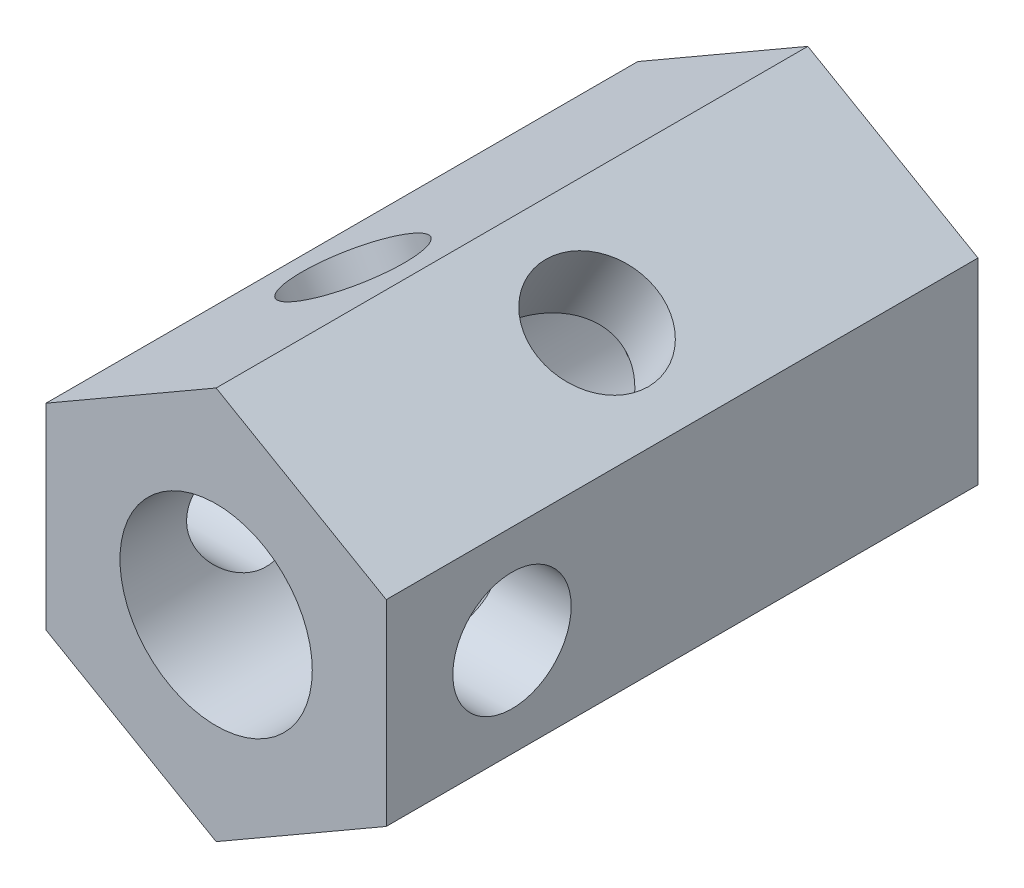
ISO-10303-21;
HEADER;
FILE_DESCRIPTION(('STEP AP214'),'2;1');
FILE_NAME('part.step','',(''),(''),'','','');
FILE_SCHEMA(('AUTOMOTIVE_DESIGN { 1 0 10303 214 1 1 1 1 }'));
ENDSEC;
DATA;
#1=APPLICATION_CONTEXT('core data for automotive mechanical design processes');
#2=APPLICATION_PROTOCOL_DEFINITION('international standard','automotive_design',2000,#1);
#3=PRODUCT_CONTEXT('',#1,'mechanical');
#4=PRODUCT('Part','Part','',(#3));
#5=PRODUCT_RELATED_PRODUCT_CATEGORY('part','',(#4));
#6=PRODUCT_DEFINITION_FORMATION('','',#4);
#7=PRODUCT_DEFINITION_CONTEXT('part definition',#1,'design');
#8=PRODUCT_DEFINITION('design','',#6,#7);
#9=PRODUCT_DEFINITION_SHAPE('','',#8);
#10=(LENGTH_UNIT() NAMED_UNIT(*) SI_UNIT(.MILLI.,.METRE.));
#11=(NAMED_UNIT(*) PLANE_ANGLE_UNIT() SI_UNIT($,.RADIAN.));
#12=(NAMED_UNIT(*) SI_UNIT($,.STERADIAN.) SOLID_ANGLE_UNIT());
#13=UNCERTAINTY_MEASURE_WITH_UNIT(LENGTH_MEASURE(1.E-05),#10,'distance_accuracy_value','');
#14=(GEOMETRIC_REPRESENTATION_CONTEXT(3) GLOBAL_UNCERTAINTY_ASSIGNED_CONTEXT((#13)) GLOBAL_UNIT_ASSIGNED_CONTEXT((#10,
#11,#12)) REPRESENTATION_CONTEXT('',''));
#15=CARTESIAN_POINT('',(0.,0.,0.));
#16=DIRECTION('',(0.,0.,1.));
#17=DIRECTION('',(1.,0.,0.));
#18=AXIS2_PLACEMENT_3D('',#15,#16,#17);
#19=CARTESIAN_POINT('',(-45.9859489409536,2.28983498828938E-13,80.));
#20=DIRECTION('',(0.,0.,-1.));
#21=DIRECTION('',(-1.,0.,0.));
#22=AXIS2_PLACEMENT_3D('',#19,#20,#21);
#23=PLANE('',#22);
#24=DIRECTION('',(-0.866025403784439,-0.5,0.));
#25=VECTOR('',#24,1.);
#26=CARTESIAN_POINT('',(0.,26.5581123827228,80.));
#27=LINE('',#26,#25);
#28=CARTESIAN_POINT('',(0.,26.5581123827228,80.));
#29=VERTEX_POINT('',#28);
#30=CARTESIAN_POINT('',(-23.,13.2790561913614,80.));
#31=VERTEX_POINT('',#30);
#32=EDGE_CURVE('E109',#29,#31,#27,.T.);
#33=ORIENTED_EDGE('',*,*,#32,.T.);
#34=DIRECTION('',(0.,-1.,0.));
#35=VECTOR('',#34,1.);
#36=CARTESIAN_POINT('',(-23.,13.2709438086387,80.));
#37=LINE('',#36,#35);
#38=CARTESIAN_POINT('',(-23.,-13.2790561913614,80.));
#39=VERTEX_POINT('',#38);
#40=EDGE_CURVE('E9',#31,#39,#37,.T.);
#41=ORIENTED_EDGE('',*,*,#40,.T.);
#42=DIRECTION('',(0.866025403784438,-0.5,0.));
#43=VECTOR('',#42,1.);
#44=CARTESIAN_POINT('',(-23.,-13.2790561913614,80.));
#45=LINE('',#44,#43);
#46=CARTESIAN_POINT('',(0.,-26.5581123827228,80.));
#47=VERTEX_POINT('',#46);
#48=EDGE_CURVE('E112',#39,#47,#45,.T.);
#49=ORIENTED_EDGE('',*,*,#48,.T.);
#50=DIRECTION('',(0.866025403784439,0.5,0.));
#51=VECTOR('',#50,1.);
#52=CARTESIAN_POINT('',(0.,-26.5581123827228,80.));
#53=LINE('',#52,#51);
#54=CARTESIAN_POINT('',(23.,-13.2790561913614,80.));
#55=VERTEX_POINT('',#54);
#56=EDGE_CURVE('E83',#47,#55,#53,.T.);
#57=ORIENTED_EDGE('',*,*,#56,.T.);
#58=DIRECTION('',(0.,-1.,0.));
#59=VECTOR('',#58,1.);
#60=CARTESIAN_POINT('',(23.,13.2709438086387,80.));
#61=LINE('',#60,#59);
#62=CARTESIAN_POINT('',(23.,13.2790561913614,80.));
#63=VERTEX_POINT('',#62);
#64=EDGE_CURVE('E29',#63,#55,#61,.T.);
#65=ORIENTED_EDGE('',*,*,#64,.F.);
#66=DIRECTION('',(-0.866025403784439,0.5,0.));
#67=VECTOR('',#66,1.);
#68=CARTESIAN_POINT('',(23.,13.2790561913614,80.));
#69=LINE('',#68,#67);
#70=EDGE_CURVE('E107',#63,#29,#69,.T.);
#71=ORIENTED_EDGE('',*,*,#70,.T.);
#72=EDGE_LOOP('',(#33,#41,#49,#57,#65,#71));
#73=FACE_BOUND('',#72,.T.);
#74=CARTESIAN_POINT('',(0.,0.,80.));
#75=DIRECTION('',(0.,0.,1.));
#76=DIRECTION('',(1.,0.,0.));
#77=AXIS2_PLACEMENT_3D('',#74,#75,#76);
#78=CIRCLE('',#77,13.);
#79=CARTESIAN_POINT('',(13.,0.,80.));
#80=VERTEX_POINT('',#79);
#81=EDGE_CURVE('E132',#80,#80,#78,.T.);
#82=ORIENTED_EDGE('',*,*,#81,.F.);
#83=EDGE_LOOP('',(#82));
#84=FACE_BOUND('',#83,.T.);
#85=ADVANCED_FACE('F14',(#73,#84),#23,.F.);
#86=CARTESIAN_POINT('',(-45.9859489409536,2.28983498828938E-13,0.));
#87=DIRECTION('',(0.,0.,-1.));
#88=DIRECTION('',(-1.,0.,0.));
#89=AXIS2_PLACEMENT_3D('',#86,#87,#88);
#90=PLANE('',#89);
#91=DIRECTION('',(0.,-1.,0.));
#92=VECTOR('',#91,1.);
#93=CARTESIAN_POINT('',(-23.,13.2709438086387,0.));
#94=LINE('',#93,#92);
#95=CARTESIAN_POINT('',(-23.,13.2790561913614,0.));
#96=VERTEX_POINT('',#95);
#97=CARTESIAN_POINT('',(-23.,-13.2790561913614,0.));
#98=VERTEX_POINT('',#97);
#99=EDGE_CURVE('E135',#96,#98,#94,.T.);
#100=ORIENTED_EDGE('',*,*,#99,.F.);
#101=DIRECTION('',(-0.866025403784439,-0.5,0.));
#102=VECTOR('',#101,1.);
#103=CARTESIAN_POINT('',(0.,26.5581123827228,0.));
#104=LINE('',#103,#102);
#105=CARTESIAN_POINT('',(0.,26.5581123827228,0.));
#106=VERTEX_POINT('',#105);
#107=EDGE_CURVE('E101',#106,#96,#104,.T.);
#108=ORIENTED_EDGE('',*,*,#107,.F.);
#109=DIRECTION('',(-0.866025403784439,0.5,0.));
#110=VECTOR('',#109,1.);
#111=CARTESIAN_POINT('',(23.,13.2790561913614,0.));
#112=LINE('',#111,#110);
#113=CARTESIAN_POINT('',(23.,13.2790561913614,0.));
#114=VERTEX_POINT('',#113);
#115=EDGE_CURVE('E103',#114,#106,#112,.T.);
#116=ORIENTED_EDGE('',*,*,#115,.F.);
#117=DIRECTION('',(0.,-1.,0.));
#118=VECTOR('',#117,1.);
#119=CARTESIAN_POINT('',(23.,13.2709438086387,0.));
#120=LINE('',#119,#118);
#121=CARTESIAN_POINT('',(23.,-13.2790561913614,0.));
#122=VERTEX_POINT('',#121);
#123=EDGE_CURVE('E38',#114,#122,#120,.T.);
#124=ORIENTED_EDGE('',*,*,#123,.T.);
#125=DIRECTION('',(0.866025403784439,0.5,0.));
#126=VECTOR('',#125,1.);
#127=CARTESIAN_POINT('',(0.,-26.5581123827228,0.));
#128=LINE('',#127,#126);
#129=CARTESIAN_POINT('',(0.,-26.5581123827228,0.));
#130=VERTEX_POINT('',#129);
#131=EDGE_CURVE('E82',#130,#122,#128,.T.);
#132=ORIENTED_EDGE('',*,*,#131,.F.);
#133=DIRECTION('',(0.866025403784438,-0.5,0.));
#134=VECTOR('',#133,1.);
#135=CARTESIAN_POINT('',(-23.,-13.2790561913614,0.));
#136=LINE('',#135,#134);
#137=EDGE_CURVE('E95',#98,#130,#136,.T.);
#138=ORIENTED_EDGE('',*,*,#137,.F.);
#139=EDGE_LOOP('',(#100,#108,#116,#124,#132,#138));
#140=FACE_BOUND('',#139,.T.);
#141=CARTESIAN_POINT('',(0.,0.,0.));
#142=DIRECTION('',(0.,0.,1.));
#143=DIRECTION('',(1.,0.,0.));
#144=AXIS2_PLACEMENT_3D('',#141,#142,#143);
#145=CIRCLE('',#144,9.);
#146=CARTESIAN_POINT('',(9.,0.,0.));
#147=VERTEX_POINT('',#146);
#148=EDGE_CURVE('E117',#147,#147,#145,.T.);
#149=ORIENTED_EDGE('',*,*,#148,.T.);
#150=EDGE_LOOP('',(#149));
#151=FACE_BOUND('',#150,.T.);
#152=ADVANCED_FACE('F93',(#140,#151),#90,.T.);
#153=CARTESIAN_POINT('',(-23.,13.2709438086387,80.));
#154=DIRECTION('',(1.,0.,0.));
#155=DIRECTION('',(0.,1.,0.));
#156=AXIS2_PLACEMENT_3D('',#153,#154,#155);
#157=PLANE('',#156);
#158=CARTESIAN_POINT('',(-23.,0.,63.));
#159=DIRECTION('',(1.,0.,0.));
#160=DIRECTION('',(0.,0.,-1.));
#161=AXIS2_PLACEMENT_3D('',#158,#159,#160);
#162=CIRCLE('',#161,8.);
#163=CARTESIAN_POINT('',(-23.,0.,55.));
#164=VERTEX_POINT('',#163);
#165=EDGE_CURVE('E143',#164,#164,#162,.T.);
#166=ORIENTED_EDGE('',*,*,#165,.T.);
#167=EDGE_LOOP('',(#166));
#168=FACE_BOUND('',#167,.T.);
#169=ORIENTED_EDGE('',*,*,#99,.T.);
#170=DIRECTION('',(0.,0.,1.));
#171=VECTOR('',#170,1.);
#172=CARTESIAN_POINT('',(-23.,-13.2790561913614,0.));
#173=LINE('',#172,#171);
#174=EDGE_CURVE('E89',#98,#39,#173,.T.);
#175=ORIENTED_EDGE('',*,*,#174,.T.);
#176=ORIENTED_EDGE('',*,*,#40,.F.);
#177=DIRECTION('',(0.,0.,1.));
#178=VECTOR('',#177,1.);
#179=CARTESIAN_POINT('',(-23.,13.2790561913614,0.));
#180=LINE('',#179,#178);
#181=EDGE_CURVE('E120',#96,#31,#180,.T.);
#182=ORIENTED_EDGE('',*,*,#181,.F.);
#183=EDGE_LOOP('',(#169,#175,#176,#182));
#184=FACE_BOUND('',#183,.T.);
#185=ADVANCED_FACE('F16',(#168,#184),#157,.F.);
#186=CARTESIAN_POINT('',(23.,13.2709438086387,80.));
#187=DIRECTION('',(1.,0.,0.));
#188=DIRECTION('',(0.,0.,-1.));
#189=AXIS2_PLACEMENT_3D('',#186,#187,#188);
#190=PLANE('',#189);
#191=CARTESIAN_POINT('',(23.,0.,63.));
#192=DIRECTION('',(1.,0.,0.));
#193=DIRECTION('',(0.,0.,-1.));
#194=AXIS2_PLACEMENT_3D('',#191,#192,#193);
#195=CIRCLE('',#194,8.);
#196=CARTESIAN_POINT('',(23.,0.,55.));
#197=VERTEX_POINT('',#196);
#198=EDGE_CURVE('E203',#197,#197,#195,.T.);
#199=ORIENTED_EDGE('',*,*,#198,.F.);
#200=EDGE_LOOP('',(#199));
#201=FACE_BOUND('',#200,.T.);
#202=ORIENTED_EDGE('',*,*,#123,.F.);
#203=DIRECTION('',(0.,0.,1.));
#204=VECTOR('',#203,1.);
#205=CARTESIAN_POINT('',(23.,13.2790561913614,0.));
#206=LINE('',#205,#204);
#207=EDGE_CURVE('E115',#114,#63,#206,.T.);
#208=ORIENTED_EDGE('',*,*,#207,.T.);
#209=ORIENTED_EDGE('',*,*,#64,.T.);
#210=DIRECTION('',(0.,0.,1.));
#211=VECTOR('',#210,1.);
#212=CARTESIAN_POINT('',(23.,-13.2790561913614,0.));
#213=LINE('',#212,#211);
#214=EDGE_CURVE('E88',#122,#55,#213,.T.);
#215=ORIENTED_EDGE('',*,*,#214,.F.);
#216=EDGE_LOOP('',(#202,#208,#209,#215));
#217=FACE_BOUND('',#216,.T.);
#218=ADVANCED_FACE('F184',(#201,#217),#190,.T.);
#219=CARTESIAN_POINT('',(0.,0.,80.));
#220=DIRECTION('',(0.,0.,1.));
#221=DIRECTION('',(1.,0.,0.));
#222=AXIS2_PLACEMENT_3D('',#219,#220,#221);
#223=CYLINDRICAL_SURFACE('',#222,13.);
#224=CARTESIAN_POINT('',(12.0516786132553,4.87411967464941,40.));
#225=CARTESIAN_POINT('',(12.0516784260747,4.87412386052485,40.1996863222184));
#226=CARTESIAN_POINT('',(12.0481219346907,4.88294269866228,40.3994276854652));
#227=CARTESIAN_POINT('',(12.0338806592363,4.91793231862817,40.7972174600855));
#228=CARTESIAN_POINT('',(12.0231912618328,4.94411433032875,40.9952646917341));
#229=CARTESIAN_POINT('',(11.994614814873,5.0130434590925,41.3883625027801));
#230=CARTESIAN_POINT('',(11.9767120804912,5.05582666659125,41.5834055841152));
#231=CARTESIAN_POINT('',(11.9336332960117,5.15668448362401,41.9687512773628));
#232=CARTESIAN_POINT('',(11.9084536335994,5.21476668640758,42.1590514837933));
#233=CARTESIAN_POINT('',(11.8509803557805,5.34408254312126,42.5320485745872));
#234=CARTESIAN_POINT('',(11.8187524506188,5.4151937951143,42.7147982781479));
#235=CARTESIAN_POINT('',(11.7469007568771,5.56934028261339,43.0737556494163));
#236=CARTESIAN_POINT('',(11.7072741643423,5.65238003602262,43.2499608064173));
#237=CARTESIAN_POINT('',(11.6204672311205,5.82875585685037,43.5951054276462));
#238=CARTESIAN_POINT('',(11.5732896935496,5.92208809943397,43.7640475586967));
#239=CARTESIAN_POINT('',(11.4711532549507,6.11758171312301,44.0942852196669));
#240=CARTESIAN_POINT('',(11.4161941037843,6.21974336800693,44.2555805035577));
#241=CARTESIAN_POINT('',(11.2905996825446,6.44523832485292,44.5905404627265));
#242=CARTESIAN_POINT('',(11.2188558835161,6.56959952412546,44.763098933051));
#243=CARTESIAN_POINT('',(11.0647405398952,6.82597177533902,45.0974563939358));
#244=CARTESIAN_POINT('',(10.982368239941,6.95798337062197,45.2592546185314));
#245=CARTESIAN_POINT('',(10.8065457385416,7.22803889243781,45.5716433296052));
#246=CARTESIAN_POINT('',(10.7130875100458,7.36608714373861,45.7222255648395));
#247=CARTESIAN_POINT('',(10.514764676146,7.64651727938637,46.0114333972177));
#248=CARTESIAN_POINT('',(10.4098979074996,7.78889998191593,46.1500567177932));
#249=CARTESIAN_POINT('',(10.1755990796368,8.09309468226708,46.4299443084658));
#250=CARTESIAN_POINT('',(10.0447285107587,8.25524317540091,46.5696465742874));
#251=CARTESIAN_POINT('',(9.76821849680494,8.58064500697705,46.8319358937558));
#252=CARTESIAN_POINT('',(9.62258574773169,8.74389781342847,46.9545306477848));
#253=CARTESIAN_POINT('',(9.31657549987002,9.06924821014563,47.1812979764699));
#254=CARTESIAN_POINT('',(9.15620481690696,9.23134629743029,47.285479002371));
#255=CARTESIAN_POINT('',(8.82105056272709,9.55211155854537,47.4740700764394));
#256=CARTESIAN_POINT('',(8.64626952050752,9.71077932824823,47.5584835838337));
#257=CARTESIAN_POINT('',(8.30116255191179,10.0068550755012,47.6988625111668));
#258=CARTESIAN_POINT('',(8.13211551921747,10.1448103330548,47.7568196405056));
#259=CARTESIAN_POINT('',(7.78398465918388,10.4143179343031,47.8547370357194));
#260=CARTESIAN_POINT('',(7.60490143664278,10.5458706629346,47.8946983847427));
#261=CARTESIAN_POINT('',(7.23819002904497,10.8008535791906,47.9559376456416));
#262=CARTESIAN_POINT('',(7.0505691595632,10.924290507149,47.9772312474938));
#263=CARTESIAN_POINT('',(6.66830641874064,11.1617334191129,48.0008147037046));
#264=CARTESIAN_POINT('',(6.47366532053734,11.2757404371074,48.0031066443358));
#265=CARTESIAN_POINT('',(6.10501842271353,11.478985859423,47.9896008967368));
#266=CARTESIAN_POINT('',(5.93163315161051,11.5695152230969,47.9761240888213));
#267=CARTESIAN_POINT('',(5.58232284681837,11.742044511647,47.9349661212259));
#268=CARTESIAN_POINT('',(5.40639783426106,11.8240445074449,47.9072850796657));
#269=CARTESIAN_POINT('',(5.05337837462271,11.9791712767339,47.8380745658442));
#270=CARTESIAN_POINT('',(4.87628394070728,12.0522981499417,47.7965452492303));
#271=CARTESIAN_POINT('',(4.52224920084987,12.1895576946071,47.7001377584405));
#272=CARTESIAN_POINT('',(4.3453089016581,12.2536899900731,47.6452590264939));
#273=CARTESIAN_POINT('',(3.99221064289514,12.3732417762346,47.5225271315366));
#274=CARTESIAN_POINT('',(3.81605777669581,12.4286291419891,47.4546280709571));
#275=CARTESIAN_POINT('',(3.46633915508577,12.5306716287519,47.3066451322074));
#276=CARTESIAN_POINT('',(3.29277428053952,12.5773238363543,47.226557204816));
#277=CARTESIAN_POINT('',(2.77770052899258,12.7046915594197,46.9690477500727));
#278=CARTESIAN_POINT('',(2.44157095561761,12.7728980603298,46.7742958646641));
#279=CARTESIAN_POINT('',(1.75200168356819,12.8867128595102,46.3176022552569));
#280=CARTESIAN_POINT('',(1.40149160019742,12.9285256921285,46.0503504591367));
#281=CARTESIAN_POINT('',(0.737484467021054,12.9833399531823,45.4697071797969));
#282=CARTESIAN_POINT('',(0.424041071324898,12.9963000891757,45.1562502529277));
#283=CARTESIAN_POINT('',(-0.0284935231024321,13.0009953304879,44.6343947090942));
#284=CARTESIAN_POINT('',(-0.18391159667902,12.9995314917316,44.4399581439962));
#285=CARTESIAN_POINT('',(-0.477807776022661,12.9920465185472,44.0386136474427));
#286=CARTESIAN_POINT('',(-0.616282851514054,12.9860245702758,43.8317034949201));
#287=CARTESIAN_POINT('',(-0.873796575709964,12.9712415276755,43.4066226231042));
#288=CARTESIAN_POINT('',(-0.992864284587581,12.9624845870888,43.1884693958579));
#289=CARTESIAN_POINT('',(-1.20933588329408,12.9440843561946,42.7417204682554));
#290=CARTESIAN_POINT('',(-1.30674874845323,12.9344414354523,42.5131291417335));
#291=CARTESIAN_POINT('',(-1.45542170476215,12.9184288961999,42.1070527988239));
#292=CARTESIAN_POINT('',(-1.51210792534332,12.9118554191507,41.931550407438));
#293=CARTESIAN_POINT('',(-1.61114880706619,12.8998719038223,41.5765211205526));
#294=CARTESIAN_POINT('',(-1.65350681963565,12.8944615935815,41.3969951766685));
#295=CARTESIAN_POINT('',(-1.72301451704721,12.885358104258,41.0351660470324));
#296=CARTESIAN_POINT('',(-1.75018033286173,12.8816631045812,40.8528660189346));
#297=CARTESIAN_POINT('',(-1.78877437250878,12.876360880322,40.4865637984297));
#298=CARTESIAN_POINT('',(-1.80020231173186,12.8747536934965,40.3025615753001));
#299=CARTESIAN_POINT('',(-1.80705806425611,12.8737933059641,39.9338979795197));
#300=CARTESIAN_POINT('',(-1.8024551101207,12.874444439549,39.7492360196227));
#301=CARTESIAN_POINT('',(-1.77729026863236,12.8779423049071,39.3810292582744));
#302=CARTESIAN_POINT('',(-1.75672829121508,12.8807890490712,39.1974844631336));
#303=CARTESIAN_POINT('',(-1.70010106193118,12.8883849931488,38.8327600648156));
#304=CARTESIAN_POINT('',(-1.66402795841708,12.8931351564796,38.6515817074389));
#305=CARTESIAN_POINT('',(-1.57712108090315,12.9040537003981,38.292784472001));
#306=CARTESIAN_POINT('',(-1.52628123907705,12.9102226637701,38.1151670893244));
#307=CARTESIAN_POINT('',(-1.41141860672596,12.9232811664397,37.7664157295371));
#308=CARTESIAN_POINT('',(-1.34754390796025,12.930162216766,37.5952324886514));
#309=CARTESIAN_POINT('',(-1.20728143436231,12.9440115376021,37.2580506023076));
#310=CARTESIAN_POINT('',(-1.13088957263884,12.9509798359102,37.0920536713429));
#311=CARTESIAN_POINT('',(-0.884499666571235,12.9709220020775,36.6027882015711));
#312=CARTESIAN_POINT('',(-0.697229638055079,12.9829408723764,36.288074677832));
#313=CARTESIAN_POINT('',(-0.245638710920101,12.9999847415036,35.6284165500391));
#314=CARTESIAN_POINT('',(0.0265406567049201,13.0032838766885,35.2888066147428));
#315=CARTESIAN_POINT('',(0.467342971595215,12.9924343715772,34.8100089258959));
#316=CARTESIAN_POINT('',(0.619833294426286,12.9861735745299,34.6554020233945));
#317=CARTESIAN_POINT('',(0.934649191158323,12.9673152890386,34.3568351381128));
#318=CARTESIAN_POINT('',(1.09697654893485,12.9547166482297,34.2128770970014));
#319=CARTESIAN_POINT('',(1.45509382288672,12.9197409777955,33.9156914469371));
#320=CARTESIAN_POINT('',(1.65227060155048,12.8961886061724,33.7642679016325));
#321=CARTESIAN_POINT('',(2.05629680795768,12.8379623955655,33.4774412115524));
#322=CARTESIAN_POINT('',(2.26314243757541,12.8032928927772,33.3420318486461));
#323=CARTESIAN_POINT('',(2.68476249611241,12.7215623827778,33.0883913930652));
#324=CARTESIAN_POINT('',(2.89953592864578,12.674502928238,32.9701581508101));
#325=CARTESIAN_POINT('',(3.3350327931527,12.5669342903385,32.7522006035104));
#326=CARTESIAN_POINT('',(3.55575544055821,12.5064268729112,32.6524738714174));
#327=CARTESIAN_POINT('',(3.98638953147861,12.3756204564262,32.4787663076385));
#328=CARTESIAN_POINT('',(4.1960662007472,12.3062184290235,32.4035298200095));
#329=CARTESIAN_POINT('',(4.61665285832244,12.1546888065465,32.2715043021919));
#330=CARTESIAN_POINT('',(4.82756281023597,12.0725615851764,32.2147147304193));
#331=CARTESIAN_POINT('',(5.24818781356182,11.8957351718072,32.1205627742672));
#332=CARTESIAN_POINT('',(5.45790390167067,11.8010495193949,32.0831796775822));
#333=CARTESIAN_POINT('',(5.8740691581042,11.5995142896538,32.0284252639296));
#334=CARTESIAN_POINT('',(6.08051881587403,11.4926665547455,32.0110509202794));
#335=CARTESIAN_POINT('',(6.45886991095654,11.2837426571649,31.9976549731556));
#336=CARTESIAN_POINT('',(6.63150451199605,11.1831538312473,31.9989449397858));
#337=CARTESIAN_POINT('',(6.97140423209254,10.974483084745,32.0164470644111));
#338=CARTESIAN_POINT('',(7.13866955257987,10.8664014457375,32.0326586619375));
#339=CARTESIAN_POINT('',(7.46663237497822,10.6437160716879,32.0797787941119));
#340=CARTESIAN_POINT('',(7.62733031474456,10.5291127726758,32.1106863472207));
#341=CARTESIAN_POINT('',(7.94118502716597,10.2944635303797,32.1867878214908));
#342=CARTESIAN_POINT('',(8.09434161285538,10.1744174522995,32.2319820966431));
#343=CARTESIAN_POINT('',(8.38824519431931,9.93340094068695,32.3346772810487));
#344=CARTESIAN_POINT('',(8.52921741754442,9.81254631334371,32.3918063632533));
#345=CARTESIAN_POINT('',(8.80280665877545,9.56788044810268,32.5184568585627));
#346=CARTESIAN_POINT('',(8.93542093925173,9.44406825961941,32.5879823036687));
#347=CARTESIAN_POINT('',(9.32009337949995,9.0699220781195,32.8141734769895));
#348=CARTESIAN_POINT('',(9.55919858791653,8.81669786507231,32.9885314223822));
#349=CARTESIAN_POINT('',(10.0249868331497,8.28479343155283,33.3997344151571));
#350=CARTESIAN_POINT('',(10.2476646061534,8.00626096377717,33.6412447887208));
#351=CARTESIAN_POINT('',(10.6509134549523,7.4614290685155,34.1698343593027));
#352=CARTESIAN_POINT('',(10.8314354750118,7.19514417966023,34.4569659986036));
#353=CARTESIAN_POINT('',(11.0832546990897,6.79638602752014,34.9392430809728));
#354=CARTESIAN_POINT('',(11.1681124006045,6.65566699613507,35.1207589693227));
#355=CARTESIAN_POINT('',(11.3254382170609,6.38427857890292,35.4963816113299));
#356=CARTESIAN_POINT('',(11.3979041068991,6.25361100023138,35.6904906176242));
#357=CARTESIAN_POINT('',(11.5308480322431,6.00495030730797,36.0904482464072));
#358=CARTESIAN_POINT('',(11.5913314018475,5.88695156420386,36.2962915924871));
#359=CARTESIAN_POINT('',(11.7007662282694,5.66632450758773,36.7189707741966));
#360=CARTESIAN_POINT('',(11.7497214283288,5.56369120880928,36.9358030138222));
#361=CARTESIAN_POINT('',(11.826818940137,5.39747958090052,37.330096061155));
#362=CARTESIAN_POINT('',(11.8571689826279,5.33028938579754,37.5056095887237));
#363=CARTESIAN_POINT('',(11.9112138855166,5.20840008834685,37.8618297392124));
#364=CARTESIAN_POINT('',(11.9349128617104,5.15369326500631,38.042533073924));
#365=CARTESIAN_POINT('',(11.9757127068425,5.05816185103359,38.4078172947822));
#366=CARTESIAN_POINT('',(11.9928301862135,5.01730234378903,38.5923871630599));
#367=CARTESIAN_POINT('',(12.0206018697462,4.95039954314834,38.9646058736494));
#368=CARTESIAN_POINT('',(12.0312596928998,4.92434795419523,39.152252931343));
#369=CARTESIAN_POINT('',(12.04303197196,4.89545696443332,39.4502177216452));
#370=CARTESIAN_POINT('',(12.046274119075,4.88746503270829,39.5599774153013));
#371=CARTESIAN_POINT('',(12.0505977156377,4.87679468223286,39.7798191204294));
#372=CARTESIAN_POINT('',(12.051678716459,4.87411736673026,39.8899011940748));
#373=CARTESIAN_POINT('',(12.0516786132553,4.87411967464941,40.));
#374=B_SPLINE_CURVE_WITH_KNOTS('',3,(#224,#225,#226,#227,#228,#229,#230,#231,#232,#233,#234,
#235,#236,#237,#238,#239,#240,#241,#242,#243,#244,#245,#246,#247,#248,#249,#250,#251,#252,#253,
#254,#255,#256,#257,#258,#259,#260,#261,#262,#263,#264,#265,#266,#267,#268,#269,#270,#271,#272,
#273,#274,#275,#276,#277,#278,#279,#280,#281,#282,#283,#284,#285,#286,#287,#288,#289,#290,#291,
#292,#293,#294,#295,#296,#297,#298,#299,#300,#301,#302,#303,#304,#305,#306,#307,#308,#309,#310,
#311,#312,#313,#314,#315,#316,#317,#318,#319,#320,#321,#322,#323,#324,#325,#326,#327,#328,#329,
#330,#331,#332,#333,#334,#335,#336,#337,#338,#339,#340,#341,#342,#343,#344,#345,#346,#347,#348,
#349,#350,#351,#352,#353,#354,#355,#356,#357,#358,#359,#360,#361,#362,#363,#364,#365,#366,#367,
#368,#369,#370,#371,#372,#373),.UNSPECIFIED.,.T.,.F.,(4,2,2,2,2,2,2,2,2,2,2,2,2,2,2,2,2,2,2,2,2,
2,2,2,2,2,2,2,2,2,2,2,2,2,2,2,2,2,2,2,2,2,2,2,2,2,2,2,2,2,2,2,2,2,2,2,2,2,2,2,2,2,2,2,2,2,2,2,2,
2,2,2,2,2,4),(0.,0.598931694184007,1.19825113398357,1.79888084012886,2.39980921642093,
2.99535742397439,3.59113179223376,4.18668550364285,4.78225836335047,5.45502023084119,
6.12782993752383,6.80112981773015,7.4745575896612,8.22617227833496,8.97744755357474,
9.72837711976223,10.4791751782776,11.1554721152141,11.8317283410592,12.5074156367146,
13.1830287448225,13.7705046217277,14.3579756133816,14.9454400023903,15.5329289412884,
16.1225282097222,16.7123237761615,17.8911187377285,19.2144258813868,20.5396256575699,
21.2856191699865,22.0317459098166,22.7767449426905,23.5214346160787,24.0745292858,
24.6274944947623,25.1798714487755,25.7322583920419,26.2857060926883,26.8391569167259,
27.3928882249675,27.9468473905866,28.4948321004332,29.0429960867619,30.1387892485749,
31.4392783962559,32.090557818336,32.7419557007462,33.4902027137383,34.2381582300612,
34.9860200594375,35.7337837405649,36.4327365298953,37.1316687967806,37.829853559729,
38.5279326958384,39.1266005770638,39.7252459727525,40.323851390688,40.9224716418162,
41.5046615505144,42.0870411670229,43.2509305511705,44.5382277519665,45.827015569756,
46.5608521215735,47.2948203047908,48.0284610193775,48.7618631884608,49.3324323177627,
49.9026475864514,50.4714141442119,51.0398617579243,51.3700194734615,51.7002457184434),.UNSPECIFIED.);
#375=CARTESIAN_POINT('',(12.0516786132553,4.87411967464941,40.));
#376=VERTEX_POINT('',#375);
#377=EDGE_CURVE('E232',#376,#376,#374,.T.);
#378=ORIENTED_EDGE('',*,*,#377,.F.);
#379=EDGE_LOOP('',(#378));
#380=FACE_BOUND('',#379,.T.);
#381=CARTESIAN_POINT('',(1.80472784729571,-12.8741196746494,40.));
#382=CARTESIAN_POINT('',(1.80472412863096,-12.874121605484,39.8003136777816));
#383=CARTESIAN_POINT('',(1.79530854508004,-12.8754510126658,39.6005723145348));
#384=CARTESIAN_POINT('',(1.75788600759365,-12.8806125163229,39.2027825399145));
#385=CARTESIAN_POINT('',(1.72986702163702,-12.8844462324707,39.0047353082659));
#386=CARTESIAN_POINT('',(1.65588442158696,-12.8941628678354,38.6116374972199));
#387=CARTESIAN_POINT('',(1.60988170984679,-12.900050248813,38.4165944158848));
#388=CARTESIAN_POINT('',(1.5009968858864,-12.9131718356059,38.0312487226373));
#389=CARTESIAN_POINT('',(1.43810639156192,-12.92040670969,37.8409485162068));
#390=CARTESIAN_POINT('',(1.2973789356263,-12.9352913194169,37.4679514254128));
#391=CARTESIAN_POINT('',(1.21968083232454,-12.9429367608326,37.2852017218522));
#392=CARTESIAN_POINT('',(1.05026021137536,-12.9577846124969,36.9262443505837));
#393=CARTESIAN_POINT('',(0.958532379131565,-12.964986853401,36.7500391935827));
#394=CARTESIAN_POINT('',(0.762382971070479,-12.9779977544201,36.4048945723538));
#395=CARTESIAN_POINT('',(0.657966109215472,-12.9838069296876,36.2359524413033));
#396=CARTESIAN_POINT('',(0.437595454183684,-12.9931009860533,35.9057147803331));
#397=CARTESIAN_POINT('',(0.321641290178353,-12.9965857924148,35.7444194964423));
#398=CARTESIAN_POINT('',(0.0635597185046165,-13.0005653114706,35.4094595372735));
#399=CARTESIAN_POINT('',(-0.0800121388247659,-13.0006139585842,35.236901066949));
#400=CARTESIAN_POINT('',(-0.379094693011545,-12.9953322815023,34.9025436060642));
#401=CARTESIAN_POINT('',(-0.534606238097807,-12.9900015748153,34.7407453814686));
#402=CARTESIAN_POINT('',(-0.856392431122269,-12.9727625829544,34.4283566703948));
#403=CARTESIAN_POINT('',(-1.0226748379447,-12.9608495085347,34.2777744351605));
#404=CARTESIAN_POINT('',(-1.36469587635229,-12.9293119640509,33.9885666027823));
#405=CARTESIAN_POINT('',(-1.54043629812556,-12.9096860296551,33.8499432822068));
#406=CARTESIAN_POINT('',(-1.92102605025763,-12.8588746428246,33.5700556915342));
#407=CARTESIAN_POINT('',(-2.12688604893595,-12.8266116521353,33.4303534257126));
#408=CARTESIAN_POINT('',(-2.54694730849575,-12.7498478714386,33.1680641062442));
#409=CARTESIAN_POINT('',(-2.76114476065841,-12.705352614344,33.0454693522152));
#410=CARTESIAN_POINT('',(-3.19591159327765,-12.603015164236,32.8187020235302));
#411=CARTESIAN_POINT('',(-3.41647799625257,-12.54517912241,32.714520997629));
#412=CARTESIAN_POINT('',(-3.86184598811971,-12.4153096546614,32.5259299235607));
#413=CARTESIAN_POINT('',(-4.08664682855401,-12.3432787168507,32.4415164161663));
#414=CARTESIAN_POINT('',(-4.51560943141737,-12.1924451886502,32.3011374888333));
#415=CARTESIAN_POINT('',(-4.71960570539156,-12.1150237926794,32.2431803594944));
#416=CARTESIAN_POINT('',(-5.12707156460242,-11.9482874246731,32.1452629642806));
#417=CARTESIAN_POINT('',(-5.33054118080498,-11.8589731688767,32.1053016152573));
#418=CARTESIAN_POINT('',(-5.73471856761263,-11.6688832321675,32.0440623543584));
#419=CARTESIAN_POINT('',(-5.9354285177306,-11.5681172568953,32.0227687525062));
#420=CARTESIAN_POINT('',(-6.33219148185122,-11.3557894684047,31.9991852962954));
#421=CARTESIAN_POINT('',(-6.52824500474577,-11.2442288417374,31.9968933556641));
#422=CARTESIAN_POINT('',(-6.88858415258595,-11.0265939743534,32.0103991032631));
#423=CARTESIAN_POINT('',(-7.05367751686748,-10.9217026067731,32.0238759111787));
#424=CARTESIAN_POINT('',(-7.37774741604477,-10.7054556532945,32.0650338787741));
#425=CARTESIAN_POINT('',(-7.5367240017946,-10.5941001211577,32.0927149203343));
#426=CARTESIAN_POINT('',(-7.84757745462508,-10.3659396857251,32.1619254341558));
#427=CARTESIAN_POINT('',(-7.99945440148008,-10.2491348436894,32.2034547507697));
#428=CARTESIAN_POINT('',(-8.29534202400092,-10.0111615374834,32.2998622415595));
#429=CARTESIAN_POINT('',(-8.43935237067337,-9.88999289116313,32.3547409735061));
#430=CARTESIAN_POINT('',(-8.71943638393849,-9.64397672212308,32.4774728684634));
#431=CARTESIAN_POINT('',(-8.85547968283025,-9.51911754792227,32.5453719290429));
#432=CARTESIAN_POINT('',(-9.11871037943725,-9.26727358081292,32.6933548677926));
#433=CARTESIAN_POINT('',(-9.24589481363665,-9.14028809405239,32.773442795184));
#434=CARTESIAN_POINT('',(-9.61373537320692,-8.75790500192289,33.0309522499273));
#435=CARTESIAN_POINT('',(-9.84086872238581,-8.50091150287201,33.225704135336));
#436=CARTESIAN_POINT('',(-10.2842198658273,-7.96063439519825,33.6823977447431));
#437=CARTESIAN_POINT('',(-10.4956858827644,-7.6779901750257,33.9496495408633));
#438=CARTESIAN_POINT('',(-10.8751599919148,-7.13035025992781,34.5302928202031));
#439=CARTESIAN_POINT('',(-11.0431054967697,-6.86538038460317,34.8437497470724));
#440=CARTESIAN_POINT('',(-11.2734389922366,-6.4758215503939,35.3656052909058));
#441=CARTESIAN_POINT('',(-11.3498803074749,-6.34049363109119,35.5600418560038));
#442=CARTESIAN_POINT('',(-11.4903462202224,-6.08222958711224,35.9613863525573));
#443=CARTESIAN_POINT('',(-11.5543685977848,-5.95929567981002,36.1682965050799));
#444=CARTESIAN_POINT('',(-11.6703229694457,-5.72889073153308,36.5933773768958));
#445=CARTESIAN_POINT('',(-11.7222730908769,-5.62139660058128,36.8115306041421));
#446=CARTESIAN_POINT('',(-11.8145738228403,-5.42472658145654,37.2582795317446));
#447=CARTESIAN_POINT('',(-11.8549292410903,-5.33554310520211,37.4868708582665));
#448=CARTESIAN_POINT('',(-11.9153984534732,-5.19878227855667,37.8929472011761));
#449=CARTESIAN_POINT('',(-11.9380487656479,-5.14640383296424,38.068449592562));
#450=CARTESIAN_POINT('',(-11.9771911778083,-5.05464015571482,38.4234788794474));
#451=CARTESIAN_POINT('',(-11.9936847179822,-5.01525188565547,38.6030048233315));
#452=CARTESIAN_POINT('',(-12.0205547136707,-4.95050470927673,38.9648339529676));
#453=CARTESIAN_POINT('',(-12.0309376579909,-4.92513092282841,39.1471339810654));
#454=CARTESIAN_POINT('',(-12.0456428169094,-4.88905639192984,39.5134362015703));
#455=CARTESIAN_POINT('',(-12.0499649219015,-4.87835591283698,39.6974384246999));
#456=CARTESIAN_POINT('',(-12.052561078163,-4.87193846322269,40.0661020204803));
#457=CARTESIAN_POINT('',(-12.0508234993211,-4.87625030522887,40.2507639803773));
#458=CARTESIAN_POINT('',(-12.0412703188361,-4.89979262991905,40.6189707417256));
#459=CARTESIAN_POINT('',(-12.0334546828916,-4.9190231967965,40.8025155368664));
#460=CARTESIAN_POINT('',(-12.0117193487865,-4.97186178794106,41.1672399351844));
#461=CARTESIAN_POINT('',(-11.9977965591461,-5.00547709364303,41.3484182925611));
#462=CARTESIAN_POINT('',(-11.9637988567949,-5.08619992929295,41.707215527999));
#463=CARTESIAN_POINT('',(-11.943721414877,-5.13331300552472,41.8848329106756));
#464=CARTESIAN_POINT('',(-11.8975990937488,-5.23931621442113,42.2335842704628));
#465=CARTESIAN_POINT('',(-11.8716209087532,-5.29807385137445,42.4047675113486));
#466=CARTESIAN_POINT('',(-11.8134835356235,-5.42646937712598,42.7419493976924));
#467=CARTESIAN_POINT('',(-11.7813223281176,-5.49611081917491,42.9079463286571));
#468=CARTESIAN_POINT('',(-11.6753977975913,-5.7194618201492,43.3972117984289));
#469=CARTESIAN_POINT('',(-11.5921714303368,-5.88765185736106,43.711925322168));
#470=CARTESIAN_POINT('',(-11.3811363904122,-6.28726300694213,44.3715834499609));
#471=CARTESIAN_POINT('',(-11.2479038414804,-6.52462682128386,44.7111933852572));
#472=CARTESIAN_POINT('',(-11.0181067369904,-6.90094807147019,45.1899910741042));
#473=CARTESIAN_POINT('',(-10.9364395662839,-7.02987816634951,45.3445979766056));
#474=CARTESIAN_POINT('',(-10.7626998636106,-7.29308758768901,45.6431648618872));
#475=CARTESIAN_POINT('',(-10.6706254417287,-7.4273678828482,45.7871229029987));
#476=CARTESIAN_POINT('',(-10.4612769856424,-7.72001870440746,46.0843085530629));
#477=CARTESIAN_POINT('',(-10.3422916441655,-7.87900261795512,46.2357320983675));
#478=CARTESIAN_POINT('',(-10.0898531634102,-8.19978647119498,46.5225587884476));
#479=CARTESIAN_POINT('',(-9.95640567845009,-8.36158528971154,46.6579681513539));
#480=CARTESIAN_POINT('',(-9.67481495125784,-8.68585371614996,46.9116086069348));
#481=CARTESIAN_POINT('',(-9.52667355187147,-8.84832323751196,47.0298418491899));
#482=CARTESIAN_POINT('',(-9.21576794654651,-9.17169026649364,47.2477993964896));
#483=CARTESIAN_POINT('',(-9.05300566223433,-9.33258797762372,47.3475261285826));
#484=CARTESIAN_POINT('',(-8.72440693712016,-9.64012483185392,47.5212336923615));
#485=CARTESIAN_POINT('',(-8.55946468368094,-9.78700914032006,47.5964701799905));
#486=CARTESIAN_POINT('',(-8.2179428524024,-10.0754830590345,47.7284956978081));
#487=CARTESIAN_POINT('',(-8.04136361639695,-10.2170728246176,47.7852852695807));
#488=CARTESIAN_POINT('',(-7.67791494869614,-10.49293155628,47.8794372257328));
#489=CARTESIAN_POINT('',(-7.49105672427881,-10.6272081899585,47.9168203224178));
#490=CARTESIAN_POINT('',(-7.10843946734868,-10.8868502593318,47.9715747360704));
#491=CARTESIAN_POINT('',(-6.91268178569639,-11.0122170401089,47.9889490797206));
#492=CARTESIAN_POINT('',(-6.54257283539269,-11.2354167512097,48.0023450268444));
#493=CARTESIAN_POINT('',(-6.36914305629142,-11.3346282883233,48.0010550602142));
#494=CARTESIAN_POINT('',(-6.01847902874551,-11.524654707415,47.9835529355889));
#495=CARTESIAN_POINT('',(-5.84124492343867,-11.6154699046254,47.9673413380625));
#496=CARTESIAN_POINT('',(-5.48441232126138,-11.7881513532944,47.9202212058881));
#497=CARTESIAN_POINT('',(-5.30481398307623,-11.8700182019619,47.8893136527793));
#498=CARTESIAN_POINT('',(-4.94467442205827,-12.0244997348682,47.8132121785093));
#499=CARTESIAN_POINT('',(-4.76413317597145,-12.097114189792,47.7680179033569));
#500=CARTESIAN_POINT('',(-4.4084549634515,-12.2311339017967,47.6653227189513));
#501=CARTESIAN_POINT('',(-4.23330567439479,-12.292792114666,47.6081936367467));
#502=CARTESIAN_POINT('',(-3.88462419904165,-12.4073944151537,47.4815431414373));
#503=CARTESIAN_POINT('',(-3.71109255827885,-12.4603356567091,47.4120176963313));
#504=CARTESIAN_POINT('',(-3.19473624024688,-12.6063986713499,47.1858265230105));
#505=CARTESIAN_POINT('',(-2.8558850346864,-12.6868577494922,47.0114685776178));
#506=CARTESIAN_POINT('',(-2.16234816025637,-12.8242899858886,46.6002655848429));
#507=CARTESIAN_POINT('',(-1.80979308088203,-12.87786836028,46.3587552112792));
#508=CARTESIAN_POINT('',(-1.13633039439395,-12.9546761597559,45.8301656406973));
#509=CARTESIAN_POINT('',(-0.815459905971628,-12.9778703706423,45.5430340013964));
#510=CARTESIAN_POINT('',(-0.344215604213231,-12.996573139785,45.0607569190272));
#511=CARTESIAN_POINT('',(-0.179920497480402,-12.999702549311,44.8792410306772));
#512=CARTESIAN_POINT('',(0.13377167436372,-13.0002564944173,44.5036183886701));
#513=CARTESIAN_POINT('',(0.283166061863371,-12.9976800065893,44.3095093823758));
#514=CARTESIAN_POINT('',(0.564984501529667,-12.9884824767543,43.9095517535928));
#515=CARTESIAN_POINT('',(0.697416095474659,-12.9818632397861,43.7037084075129));
#516=CARTESIAN_POINT('',(0.943202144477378,-12.9663230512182,43.2810292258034));
#517=CARTESIAN_POINT('',(1.05656278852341,-12.9574028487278,43.0641969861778));
#518=CARTESIAN_POINT('',(1.23905503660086,-12.9410654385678,42.669903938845));
#519=CARTESIAN_POINT('',(1.31241847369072,-12.9337542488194,42.4943904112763));
#520=CARTESIAN_POINT('',(1.44500015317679,-12.9196138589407,42.1381702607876));
#521=CARTESIAN_POINT('',(1.50422714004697,-12.912784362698,41.957466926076));
#522=CARTESIAN_POINT('',(1.60735969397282,-12.9003523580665,41.5921827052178));
#523=CARTESIAN_POINT('',(1.65130380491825,-12.8947467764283,41.4076128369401));
#524=CARTESIAN_POINT('',(1.72312917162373,-12.8853463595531,41.0353941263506));
#525=CARTESIAN_POINT('',(1.75101942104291,-12.8815505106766,40.847747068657));
#526=CARTESIAN_POINT('',(1.7819258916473,-12.8773001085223,40.5497822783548));
#527=CARTESIAN_POINT('',(1.79046818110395,-12.8761119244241,40.4400225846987));
#528=CARTESIAN_POINT('',(1.80187077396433,-12.8745210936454,40.2201808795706));
#529=CARTESIAN_POINT('',(1.80472989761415,-12.8741186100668,40.1100988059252));
#530=CARTESIAN_POINT('',(1.80472784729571,-12.8741196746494,40.));
#531=B_SPLINE_CURVE_WITH_KNOTS('',3,(#381,#382,#383,#384,#385,#386,#387,#388,#389,#390,#391,
#392,#393,#394,#395,#396,#397,#398,#399,#400,#401,#402,#403,#404,#405,#406,#407,#408,#409,#410,
#411,#412,#413,#414,#415,#416,#417,#418,#419,#420,#421,#422,#423,#424,#425,#426,#427,#428,#429,
#430,#431,#432,#433,#434,#435,#436,#437,#438,#439,#440,#441,#442,#443,#444,#445,#446,#447,#448,
#449,#450,#451,#452,#453,#454,#455,#456,#457,#458,#459,#460,#461,#462,#463,#464,#465,#466,#467,
#468,#469,#470,#471,#472,#473,#474,#475,#476,#477,#478,#479,#480,#481,#482,#483,#484,#485,#486,
#487,#488,#489,#490,#491,#492,#493,#494,#495,#496,#497,#498,#499,#500,#501,#502,#503,#504,#505,
#506,#507,#508,#509,#510,#511,#512,#513,#514,#515,#516,#517,#518,#519,#520,#521,#522,#523,#524,
#525,#526,#527,#528,#529,#530),.UNSPECIFIED.,.T.,.F.,(4,2,2,2,2,2,2,2,2,2,2,2,2,2,2,2,2,2,2,2,2,
2,2,2,2,2,2,2,2,2,2,2,2,2,2,2,2,2,2,2,2,2,2,2,2,2,2,2,2,2,2,2,2,2,2,2,2,2,2,2,2,2,2,2,2,2,2,2,2,
2,2,2,2,2,4),(0.,0.598931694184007,1.19825113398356,1.79888084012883,2.39980921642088,
2.99535742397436,3.59113179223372,4.18668550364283,4.78225836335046,5.45502023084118,
6.12782993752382,6.80112981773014,7.4745575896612,8.22617227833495,8.97744755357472,
9.72837711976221,10.4791751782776,11.1554721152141,11.8317283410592,12.5074156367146,
13.1830287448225,13.7705046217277,14.3579756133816,14.9454400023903,15.5329289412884,
16.1225282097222,16.7123237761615,17.8911187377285,19.2144258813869,20.5396256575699,
21.2856191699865,22.0317459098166,22.7767449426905,23.5214346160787,24.0745292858,
24.6274944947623,25.1798714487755,25.7322583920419,26.2857060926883,26.8391569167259,
27.3928882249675,27.9468473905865,28.4948321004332,29.0429960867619,30.1387892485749,
31.4392783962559,32.090557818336,32.7419557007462,33.4902027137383,34.2381582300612,
34.9860200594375,35.7337837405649,36.4327365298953,37.1316687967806,37.829853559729,
38.5279326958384,39.1266005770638,39.7252459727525,40.323851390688,40.9224716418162,
41.5046615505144,42.0870411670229,43.2509305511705,44.5382277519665,45.8270155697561,
46.5608521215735,47.2948203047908,48.0284610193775,48.7618631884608,49.3324323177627,
49.9026475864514,50.4714141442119,51.0398617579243,51.3700194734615,51.7002457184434),.UNSPECIFIED.);
#532=CARTESIAN_POINT('',(1.80472784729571,-12.8741196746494,40.));
#533=VERTEX_POINT('',#532);
#534=EDGE_CURVE('E238',#533,#533,#531,.T.);
#535=ORIENTED_EDGE('',*,*,#534,.F.);
#536=EDGE_LOOP('',(#535));
#537=FACE_BOUND('',#536,.T.);
#538=CARTESIAN_POINT('',(1.8047278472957,12.8741196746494,50.));
#539=CARTESIAN_POINT('',(1.80472412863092,12.874121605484,50.1996863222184));
#540=CARTESIAN_POINT('',(1.79530854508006,12.8754510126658,50.3994276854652));
#541=CARTESIAN_POINT('',(1.75788600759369,12.8806125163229,50.7972174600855));
#542=CARTESIAN_POINT('',(1.72986702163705,12.8844462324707,50.9952646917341));
#543=CARTESIAN_POINT('',(1.65588442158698,12.8941628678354,51.3883625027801));
#544=CARTESIAN_POINT('',(1.60988170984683,12.900050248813,51.5834055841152));
#545=CARTESIAN_POINT('',(1.50099688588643,12.9131718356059,51.9687512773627));
#546=CARTESIAN_POINT('',(1.43810639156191,12.92040670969,52.1590514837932));
#547=CARTESIAN_POINT('',(1.29737893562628,12.9352913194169,52.5320485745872));
#548=CARTESIAN_POINT('',(1.21968083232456,12.9429367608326,52.7147982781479));
#549=CARTESIAN_POINT('',(1.05026021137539,12.9577846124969,53.0737556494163));
#550=CARTESIAN_POINT('',(0.958532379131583,12.964986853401,53.2499608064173));
#551=CARTESIAN_POINT('',(0.76238297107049,12.9779977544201,53.5951054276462));
#552=CARTESIAN_POINT('',(0.657966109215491,12.9838069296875,53.7640475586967));
#553=CARTESIAN_POINT('',(0.437595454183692,12.9931009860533,54.0942852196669));
#554=CARTESIAN_POINT('',(0.321641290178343,12.9965857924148,54.2555805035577));
#555=CARTESIAN_POINT('',(0.0635597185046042,13.0005653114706,54.5905404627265));
#556=CARTESIAN_POINT('',(-0.0800121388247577,13.0006139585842,54.763098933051));
#557=CARTESIAN_POINT('',(-0.379094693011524,12.9953322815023,55.0974563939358));
#558=CARTESIAN_POINT('',(-0.534606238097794,12.9900015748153,55.2592546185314));
#559=CARTESIAN_POINT('',(-0.85639243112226,12.9727625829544,55.5716433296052));
#560=CARTESIAN_POINT('',(-1.02267483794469,12.9608495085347,55.7222255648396));
#561=CARTESIAN_POINT('',(-1.36469587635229,12.9293119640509,56.0114333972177));
#562=CARTESIAN_POINT('',(-1.54043629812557,12.9096860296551,56.1500567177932));
#563=CARTESIAN_POINT('',(-1.92102605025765,12.8588746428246,56.4299443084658));
#564=CARTESIAN_POINT('',(-2.12688604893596,12.8266116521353,56.5696465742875));
#565=CARTESIAN_POINT('',(-2.54694730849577,12.7498478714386,56.8319358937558));
#566=CARTESIAN_POINT('',(-2.76114476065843,12.705352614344,56.9545306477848));
#567=CARTESIAN_POINT('',(-3.19591159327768,12.603015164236,57.1812979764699));
#568=CARTESIAN_POINT('',(-3.4164779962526,12.54517912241,57.285479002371));
#569=CARTESIAN_POINT('',(-3.86184598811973,12.4153096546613,57.4740700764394));
#570=CARTESIAN_POINT('',(-4.08664682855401,12.3432787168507,57.5584835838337));
#571=CARTESIAN_POINT('',(-4.51560943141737,12.1924451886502,57.6988625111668));
#572=CARTESIAN_POINT('',(-4.71960570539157,12.1150237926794,57.7568196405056));
#573=CARTESIAN_POINT('',(-5.12707156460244,11.9482874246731,57.8547370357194));
#574=CARTESIAN_POINT('',(-5.330541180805,11.8589731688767,57.8946983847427));
#575=CARTESIAN_POINT('',(-5.73471856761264,11.6688832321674,57.9559376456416));
#576=CARTESIAN_POINT('',(-5.93542851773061,11.5681172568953,57.9772312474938));
#577=CARTESIAN_POINT('',(-6.33219148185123,11.3557894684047,58.0008147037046));
#578=CARTESIAN_POINT('',(-6.52824500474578,11.2442288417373,58.0031066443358));
#579=CARTESIAN_POINT('',(-6.88858415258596,11.0265939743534,57.9896008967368));
#580=CARTESIAN_POINT('',(-7.0536775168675,10.9217026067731,57.9761240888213));
#581=CARTESIAN_POINT('',(-7.37774741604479,10.7054556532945,57.9349661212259));
#582=CARTESIAN_POINT('',(-7.53672400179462,10.5941001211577,57.9072850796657));
#583=CARTESIAN_POINT('',(-7.84757745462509,10.3659396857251,57.8380745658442));
#584=CARTESIAN_POINT('',(-7.99945440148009,10.2491348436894,57.7965452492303));
#585=CARTESIAN_POINT('',(-8.29534202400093,10.0111615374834,57.7001377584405));
#586=CARTESIAN_POINT('',(-8.43935237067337,9.88999289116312,57.6452590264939));
#587=CARTESIAN_POINT('',(-8.71943638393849,9.64397672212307,57.5225271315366));
#588=CARTESIAN_POINT('',(-8.85547968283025,9.51911754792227,57.4546280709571));
#589=CARTESIAN_POINT('',(-9.11871037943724,9.26727358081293,57.3066451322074));
#590=CARTESIAN_POINT('',(-9.24589481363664,9.1402880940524,57.226557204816));
#591=CARTESIAN_POINT('',(-9.61373537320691,8.75790500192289,56.9690477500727));
#592=CARTESIAN_POINT('',(-9.84086872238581,8.50091150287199,56.7742958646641));
#593=CARTESIAN_POINT('',(-10.2842198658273,7.96063439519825,56.3176022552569));
#594=CARTESIAN_POINT('',(-10.4956858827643,7.67799017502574,56.0503504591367));
#595=CARTESIAN_POINT('',(-10.8751599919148,7.13035025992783,55.4697071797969));
#596=CARTESIAN_POINT('',(-11.0431054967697,6.86538038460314,55.1562502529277));
#597=CARTESIAN_POINT('',(-11.2734389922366,6.47582155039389,54.6343947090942));
#598=CARTESIAN_POINT('',(-11.3498803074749,6.34049363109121,54.4399581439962));
#599=CARTESIAN_POINT('',(-11.4903462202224,6.08222958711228,54.0386136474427));
#600=CARTESIAN_POINT('',(-11.5543685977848,5.95929567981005,53.8317034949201));
#601=CARTESIAN_POINT('',(-11.6703229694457,5.7288907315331,53.4066226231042));
#602=CARTESIAN_POINT('',(-11.7222730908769,5.6213966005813,53.1884693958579));
#603=CARTESIAN_POINT('',(-11.8145738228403,5.42472658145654,52.7417204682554));
#604=CARTESIAN_POINT('',(-11.8549292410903,5.3355431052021,52.5131291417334));
#605=CARTESIAN_POINT('',(-11.9153984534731,5.19878227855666,52.1070527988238));
#606=CARTESIAN_POINT('',(-11.9380487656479,5.14640383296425,51.931550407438));
#607=CARTESIAN_POINT('',(-11.9771911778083,5.05464015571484,51.5765211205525));
#608=CARTESIAN_POINT('',(-11.9936847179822,5.01525188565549,51.3969951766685));
#609=CARTESIAN_POINT('',(-12.0205547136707,4.95050470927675,51.0351660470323));
#610=CARTESIAN_POINT('',(-12.0309376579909,4.92513092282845,50.8528660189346));
#611=CARTESIAN_POINT('',(-12.0456428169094,4.88905639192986,50.4865637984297));
#612=CARTESIAN_POINT('',(-12.0499649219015,4.87835591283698,50.3025615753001));
#613=CARTESIAN_POINT('',(-12.052561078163,4.87193846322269,49.9338979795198));
#614=CARTESIAN_POINT('',(-12.0508234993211,4.87625030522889,49.7492360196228));
#615=CARTESIAN_POINT('',(-12.041270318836,4.89979262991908,49.3810292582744));
#616=CARTESIAN_POINT('',(-12.0334546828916,4.91902319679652,49.1974844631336));
#617=CARTESIAN_POINT('',(-12.0117193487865,4.97186178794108,48.8327600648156));
#618=CARTESIAN_POINT('',(-11.9977965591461,5.00547709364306,48.6515817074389));
#619=CARTESIAN_POINT('',(-11.9637988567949,5.08619992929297,48.292784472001));
#620=CARTESIAN_POINT('',(-11.943721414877,5.13331300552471,48.1151670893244));
#621=CARTESIAN_POINT('',(-11.8975990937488,5.23931621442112,47.7664157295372));
#622=CARTESIAN_POINT('',(-11.8716209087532,5.29807385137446,47.5952324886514));
#623=CARTESIAN_POINT('',(-11.8134835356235,5.42646937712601,47.2580506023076));
#624=CARTESIAN_POINT('',(-11.7813223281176,5.49611081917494,47.0920536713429));
#625=CARTESIAN_POINT('',(-11.6753977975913,5.71946182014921,46.6027882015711));
#626=CARTESIAN_POINT('',(-11.5921714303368,5.88765185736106,46.288074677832));
#627=CARTESIAN_POINT('',(-11.3811363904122,6.28726300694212,45.6284165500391));
#628=CARTESIAN_POINT('',(-11.2479038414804,6.52462682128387,45.2888066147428));
#629=CARTESIAN_POINT('',(-11.0181067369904,6.90094807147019,44.8100089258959));
#630=CARTESIAN_POINT('',(-10.9364395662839,7.02987816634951,44.6554020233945));
#631=CARTESIAN_POINT('',(-10.7626998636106,7.29308758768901,44.3568351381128));
#632=CARTESIAN_POINT('',(-10.6706254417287,7.4273678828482,44.2128770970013));
#633=CARTESIAN_POINT('',(-10.4612769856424,7.72001870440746,43.9156914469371));
#634=CARTESIAN_POINT('',(-10.3422916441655,7.87900261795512,43.7642679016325));
#635=CARTESIAN_POINT('',(-10.0898531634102,8.19978647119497,43.4774412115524));
#636=CARTESIAN_POINT('',(-9.95640567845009,8.36158528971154,43.3420318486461));
#637=CARTESIAN_POINT('',(-9.67481495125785,8.68585371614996,43.0883913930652));
#638=CARTESIAN_POINT('',(-9.52667355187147,8.84832323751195,42.9701581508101));
#639=CARTESIAN_POINT('',(-9.21576794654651,9.17169026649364,42.7522006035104));
#640=CARTESIAN_POINT('',(-9.05300566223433,9.33258797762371,42.6524738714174));
#641=CARTESIAN_POINT('',(-8.72440693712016,9.64012483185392,42.4787663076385));
#642=CARTESIAN_POINT('',(-8.55946468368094,9.78700914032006,42.4035298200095));
#643=CARTESIAN_POINT('',(-8.2179428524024,10.0754830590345,42.2715043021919));
#644=CARTESIAN_POINT('',(-8.04136361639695,10.2170728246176,42.2147147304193));
#645=CARTESIAN_POINT('',(-7.67791494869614,10.49293155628,42.1205627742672));
#646=CARTESIAN_POINT('',(-7.49105672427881,10.6272081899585,42.0831796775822));
#647=CARTESIAN_POINT('',(-7.10843946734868,10.8868502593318,42.0284252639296));
#648=CARTESIAN_POINT('',(-6.91268178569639,11.0122170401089,42.0110509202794));
#649=CARTESIAN_POINT('',(-6.54257283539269,11.2354167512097,41.9976549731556));
#650=CARTESIAN_POINT('',(-6.36914305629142,11.3346282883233,41.9989449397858));
#651=CARTESIAN_POINT('',(-6.01847902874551,11.524654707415,42.0164470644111));
#652=CARTESIAN_POINT('',(-5.84124492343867,11.6154699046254,42.0326586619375));
#653=CARTESIAN_POINT('',(-5.48441232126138,11.7881513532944,42.0797787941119));
#654=CARTESIAN_POINT('',(-5.30481398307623,11.8700182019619,42.1106863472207));
#655=CARTESIAN_POINT('',(-4.94467442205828,12.0244997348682,42.1867878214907));
#656=CARTESIAN_POINT('',(-4.76413317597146,12.097114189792,42.2319820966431));
#657=CARTESIAN_POINT('',(-4.4084549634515,12.2311339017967,42.3346772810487));
#658=CARTESIAN_POINT('',(-4.23330567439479,12.292792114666,42.3918063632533));
#659=CARTESIAN_POINT('',(-3.88462419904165,12.4073944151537,42.5184568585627));
#660=CARTESIAN_POINT('',(-3.71109255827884,12.4603356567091,42.5879823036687));
#661=CARTESIAN_POINT('',(-3.19473624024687,12.6063986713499,42.8141734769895));
#662=CARTESIAN_POINT('',(-2.8558850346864,12.6868577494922,42.9885314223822));
#663=CARTESIAN_POINT('',(-2.16234816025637,12.8242899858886,43.3997344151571));
#664=CARTESIAN_POINT('',(-1.80979308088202,12.87786836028,43.6412447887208));
#665=CARTESIAN_POINT('',(-1.13633039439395,12.9546761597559,44.1698343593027));
#666=CARTESIAN_POINT('',(-0.815459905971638,12.9778703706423,44.4569659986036));
#667=CARTESIAN_POINT('',(-0.344215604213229,12.996573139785,44.9392430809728));
#668=CARTESIAN_POINT('',(-0.179920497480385,12.999702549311,45.1207589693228));
#669=CARTESIAN_POINT('',(0.133771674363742,13.0002564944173,45.4963816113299));
#670=CARTESIAN_POINT('',(0.283166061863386,12.9976800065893,45.6904906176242));
#671=CARTESIAN_POINT('',(0.564984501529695,12.9884824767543,46.0904482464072));
#672=CARTESIAN_POINT('',(0.697416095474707,12.9818632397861,46.2962915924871));
#673=CARTESIAN_POINT('',(0.943202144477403,12.9663230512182,46.7189707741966));
#674=CARTESIAN_POINT('',(1.05656278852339,12.9574028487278,46.9358030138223));
#675=CARTESIAN_POINT('',(1.23905503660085,12.9410654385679,47.330096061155));
#676=CARTESIAN_POINT('',(1.31241847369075,12.9337542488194,47.5056095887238));
#677=CARTESIAN_POINT('',(1.44500015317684,12.9196138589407,47.8618297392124));
#678=CARTESIAN_POINT('',(1.504227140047,12.912784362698,48.0425330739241));
#679=CARTESIAN_POINT('',(1.60735969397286,12.9003523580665,48.4078172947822));
#680=CARTESIAN_POINT('',(1.6513038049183,12.8947467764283,48.5923871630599));
#681=CARTESIAN_POINT('',(1.72312917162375,12.8853463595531,48.9646058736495));
#682=CARTESIAN_POINT('',(1.75101942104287,12.8815505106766,49.152252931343));
#683=CARTESIAN_POINT('',(1.7819258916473,12.8773001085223,49.4502177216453));
#684=CARTESIAN_POINT('',(1.79046818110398,12.8761119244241,49.5599774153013));
#685=CARTESIAN_POINT('',(1.80187077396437,12.8745210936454,49.7798191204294));
#686=CARTESIAN_POINT('',(1.80472989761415,12.8741186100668,49.8899011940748));
#687=CARTESIAN_POINT('',(1.8047278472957,12.8741196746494,50.));
#688=B_SPLINE_CURVE_WITH_KNOTS('',3,(#538,#539,#540,#541,#542,#543,#544,#545,#546,#547,#548,
#549,#550,#551,#552,#553,#554,#555,#556,#557,#558,#559,#560,#561,#562,#563,#564,#565,#566,#567,
#568,#569,#570,#571,#572,#573,#574,#575,#576,#577,#578,#579,#580,#581,#582,#583,#584,#585,#586,
#587,#588,#589,#590,#591,#592,#593,#594,#595,#596,#597,#598,#599,#600,#601,#602,#603,#604,#605,
#606,#607,#608,#609,#610,#611,#612,#613,#614,#615,#616,#617,#618,#619,#620,#621,#622,#623,#624,
#625,#626,#627,#628,#629,#630,#631,#632,#633,#634,#635,#636,#637,#638,#639,#640,#641,#642,#643,
#644,#645,#646,#647,#648,#649,#650,#651,#652,#653,#654,#655,#656,#657,#658,#659,#660,#661,#662,
#663,#664,#665,#666,#667,#668,#669,#670,#671,#672,#673,#674,#675,#676,#677,#678,#679,#680,#681,
#682,#683,#684,#685,#686,#687),.UNSPECIFIED.,.T.,.F.,(4,2,2,2,2,2,2,2,2,2,2,2,2,2,2,2,2,2,2,2,2,
2,2,2,2,2,2,2,2,2,2,2,2,2,2,2,2,2,2,2,2,2,2,2,2,2,2,2,2,2,2,2,2,2,2,2,2,2,2,2,2,2,2,2,2,2,2,2,2,
2,2,2,2,2,4),(0.,0.598931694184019,1.19825113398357,1.79888084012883,2.39980921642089,
2.99535742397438,3.59113179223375,4.18668550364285,4.78225836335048,5.4550202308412,
6.12782993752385,6.80112981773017,7.47455758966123,8.22617227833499,8.97744755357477,
9.72837711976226,10.4791751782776,11.1554721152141,11.8317283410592,12.5074156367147,
13.1830287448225,13.7705046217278,14.3579756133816,14.9454400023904,15.5329289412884,
16.1225282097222,16.7123237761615,17.8911187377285,19.2144258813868,20.5396256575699,
21.2856191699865,22.0317459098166,22.7767449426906,23.5214346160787,24.0745292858,
24.6274944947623,25.1798714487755,25.7322583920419,26.2857060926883,26.8391569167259,
27.3928882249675,27.9468473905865,28.4948321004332,29.0429960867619,30.1387892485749,
31.4392783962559,32.0905578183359,32.7419557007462,33.4902027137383,34.2381582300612,
34.9860200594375,35.7337837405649,36.4327365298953,37.1316687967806,37.829853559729,
38.5279326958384,39.1266005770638,39.7252459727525,40.323851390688,40.9224716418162,
41.5046615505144,42.0870411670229,43.2509305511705,44.5382277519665,45.827015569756,
46.5608521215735,47.2948203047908,48.0284610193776,48.7618631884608,49.3324323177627,
49.9026475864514,50.4714141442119,51.0398617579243,51.3700194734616,51.7002457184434),.UNSPECIFIED.);
#689=CARTESIAN_POINT('',(1.8047278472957,12.8741196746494,50.));
#690=VERTEX_POINT('',#689);
#691=EDGE_CURVE('E205',#690,#690,#688,.T.);
#692=ORIENTED_EDGE('',*,*,#691,.F.);
#693=EDGE_LOOP('',(#692));
#694=FACE_BOUND('',#693,.T.);
#695=CARTESIAN_POINT('',(12.0516786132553,-4.87411967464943,50.));
#696=CARTESIAN_POINT('',(12.0516784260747,-4.87412386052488,49.8003136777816));
#697=CARTESIAN_POINT('',(12.0481219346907,-4.88294269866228,49.6005723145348));
#698=CARTESIAN_POINT('',(12.0338806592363,-4.91793231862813,49.2027825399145));
#699=CARTESIAN_POINT('',(12.0231912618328,-4.94411433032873,49.0047353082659));
#700=CARTESIAN_POINT('',(11.994614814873,-5.01304345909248,48.6116374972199));
#701=CARTESIAN_POINT('',(11.9767120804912,-5.05582666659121,48.4165944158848));
#702=CARTESIAN_POINT('',(11.9336332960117,-5.15668448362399,48.0312487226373));
#703=CARTESIAN_POINT('',(11.9084536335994,-5.2147666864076,47.8409485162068));
#704=CARTESIAN_POINT('',(11.8509803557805,-5.34408254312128,47.4679514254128));
#705=CARTESIAN_POINT('',(11.8187524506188,-5.4151937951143,47.2852017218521));
#706=CARTESIAN_POINT('',(11.7469007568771,-5.56934028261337,46.9262443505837));
#707=CARTESIAN_POINT('',(11.7072741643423,-5.6523800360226,46.7500391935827));
#708=CARTESIAN_POINT('',(11.6204672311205,-5.82875585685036,46.4048945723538));
#709=CARTESIAN_POINT('',(11.5732896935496,-5.92208809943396,46.2359524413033));
#710=CARTESIAN_POINT('',(11.4711532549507,-6.11758171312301,45.9057147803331));
#711=CARTESIAN_POINT('',(11.4161941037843,-6.21974336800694,45.7444194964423));
#712=CARTESIAN_POINT('',(11.2905996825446,-6.44523832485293,45.4094595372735));
#713=CARTESIAN_POINT('',(11.2188558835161,-6.56959952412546,45.236901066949));
#714=CARTESIAN_POINT('',(11.0647405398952,-6.82597177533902,44.9025436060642));
#715=CARTESIAN_POINT('',(10.982368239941,-6.95798337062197,44.7407453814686));
#716=CARTESIAN_POINT('',(10.8065457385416,-7.22803889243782,44.4283566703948));
#717=CARTESIAN_POINT('',(10.7130875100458,-7.36608714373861,44.2777744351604));
#718=CARTESIAN_POINT('',(10.514764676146,-7.64651727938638,43.9885666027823));
#719=CARTESIAN_POINT('',(10.4098979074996,-7.78889998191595,43.8499432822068));
#720=CARTESIAN_POINT('',(10.1755990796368,-8.0930946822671,43.5700556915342));
#721=CARTESIAN_POINT('',(10.0447285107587,-8.25524317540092,43.4303534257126));
#722=CARTESIAN_POINT('',(9.76821849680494,-8.58064500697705,43.1680641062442));
#723=CARTESIAN_POINT('',(9.62258574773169,-8.74389781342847,43.0454693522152));
#724=CARTESIAN_POINT('',(9.31657549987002,-9.06924821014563,42.8187020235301));
#725=CARTESIAN_POINT('',(9.15620481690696,-9.23134629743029,42.714520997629));
#726=CARTESIAN_POINT('',(8.82105056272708,-9.55211155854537,42.5259299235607));
#727=CARTESIAN_POINT('',(8.6462695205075,-9.71077932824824,42.4415164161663));
#728=CARTESIAN_POINT('',(8.30116255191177,-10.0068550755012,42.3011374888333));
#729=CARTESIAN_POINT('',(8.13211551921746,-10.1448103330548,42.2431803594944));
#730=CARTESIAN_POINT('',(7.78398465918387,-10.4143179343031,42.1452629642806));
#731=CARTESIAN_POINT('',(7.60490143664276,-10.5458706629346,42.1053016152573));
#732=CARTESIAN_POINT('',(7.23819002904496,-10.8008535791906,42.0440623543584));
#733=CARTESIAN_POINT('',(7.05056915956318,-10.924290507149,42.0227687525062));
#734=CARTESIAN_POINT('',(6.66830641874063,-11.1617334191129,41.9991852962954));
#735=CARTESIAN_POINT('',(6.47366532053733,-11.2757404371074,41.9968933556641));
#736=CARTESIAN_POINT('',(6.10501842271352,-11.478985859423,42.0103991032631));
#737=CARTESIAN_POINT('',(5.9316331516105,-11.5695152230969,42.0238759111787));
#738=CARTESIAN_POINT('',(5.58232284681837,-11.742044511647,42.0650338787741));
#739=CARTESIAN_POINT('',(5.40639783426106,-11.8240445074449,42.0927149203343));
#740=CARTESIAN_POINT('',(5.0533783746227,-11.9791712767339,42.1619254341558));
#741=CARTESIAN_POINT('',(4.87628394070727,-12.0522981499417,42.2034547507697));
#742=CARTESIAN_POINT('',(4.52224920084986,-12.1895576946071,42.2998622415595));
#743=CARTESIAN_POINT('',(4.34530890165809,-12.2536899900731,42.3547409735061));
#744=CARTESIAN_POINT('',(3.99221064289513,-12.3732417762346,42.4774728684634));
#745=CARTESIAN_POINT('',(3.8160577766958,-12.4286291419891,42.5453719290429));
#746=CARTESIAN_POINT('',(3.46633915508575,-12.530671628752,42.6933548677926));
#747=CARTESIAN_POINT('',(3.2927742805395,-12.5773238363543,42.773442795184));
#748=CARTESIAN_POINT('',(2.77770052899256,-12.7046915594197,43.0309522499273));
#749=CARTESIAN_POINT('',(2.4415709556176,-12.7728980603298,43.225704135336));
#750=CARTESIAN_POINT('',(1.75200168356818,-12.8867128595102,43.6823977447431));
#751=CARTESIAN_POINT('',(1.4014916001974,-12.9285256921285,43.9496495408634));
#752=CARTESIAN_POINT('',(0.737484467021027,-12.9833399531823,44.5302928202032));
#753=CARTESIAN_POINT('',(0.424041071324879,-12.9963000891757,44.8437497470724));
#754=CARTESIAN_POINT('',(-0.0284935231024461,-13.0009953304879,45.3656052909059));
#755=CARTESIAN_POINT('',(-0.183911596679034,-12.9995314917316,45.5600418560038));
#756=CARTESIAN_POINT('',(-0.477807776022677,-12.9920465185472,45.9613863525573));
#757=CARTESIAN_POINT('',(-0.616282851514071,-12.9860245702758,46.1682965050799));
#758=CARTESIAN_POINT('',(-0.873796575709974,-12.9712415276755,46.5933773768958));
#759=CARTESIAN_POINT('',(-0.992864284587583,-12.9624845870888,46.8115306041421));
#760=CARTESIAN_POINT('',(-1.20933588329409,-12.9440843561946,47.2582795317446));
#761=CARTESIAN_POINT('',(-1.30674874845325,-12.9344414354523,47.4868708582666));
#762=CARTESIAN_POINT('',(-1.45542170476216,-12.9184288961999,47.8929472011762));
#763=CARTESIAN_POINT('',(-1.51210792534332,-12.9118554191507,48.0684495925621));
#764=CARTESIAN_POINT('',(-1.61114880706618,-12.8998719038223,48.4234788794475));
#765=CARTESIAN_POINT('',(-1.65350681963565,-12.8944615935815,48.6030048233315));
#766=CARTESIAN_POINT('',(-1.72301451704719,-12.885358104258,48.9648339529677));
#767=CARTESIAN_POINT('',(-1.75018033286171,-12.8816631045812,49.1471339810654));
#768=CARTESIAN_POINT('',(-1.78877437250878,-12.876360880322,49.5134362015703));
#769=CARTESIAN_POINT('',(-1.80020231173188,-12.8747536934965,49.6974384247));
#770=CARTESIAN_POINT('',(-1.80705806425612,-12.8737933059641,50.0661020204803));
#771=CARTESIAN_POINT('',(-1.80245511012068,-12.874444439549,50.2507639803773));
#772=CARTESIAN_POINT('',(-1.77729026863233,-12.8779423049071,50.6189707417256));
#773=CARTESIAN_POINT('',(-1.75672829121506,-12.8807890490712,50.8025155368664));
#774=CARTESIAN_POINT('',(-1.70010106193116,-12.8883849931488,51.1672399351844));
#775=CARTESIAN_POINT('',(-1.66402795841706,-12.8931351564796,51.3484182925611));
#776=CARTESIAN_POINT('',(-1.57712108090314,-12.9040537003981,51.707215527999));
#777=CARTESIAN_POINT('',(-1.52628123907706,-12.9102226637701,51.8848329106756));
#778=CARTESIAN_POINT('',(-1.41141860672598,-12.9232811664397,52.2335842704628));
#779=CARTESIAN_POINT('',(-1.34754390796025,-12.930162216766,52.4047675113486));
#780=CARTESIAN_POINT('',(-1.2072814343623,-12.9440115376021,52.7419493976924));
#781=CARTESIAN_POINT('',(-1.13088957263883,-12.9509798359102,52.9079463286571));
#782=CARTESIAN_POINT('',(-0.884499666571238,-12.9709220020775,53.3972117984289));
#783=CARTESIAN_POINT('',(-0.697229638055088,-12.9829408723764,53.711925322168));
#784=CARTESIAN_POINT('',(-0.245638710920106,-12.9999847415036,54.3715834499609));
#785=CARTESIAN_POINT('',(0.0265406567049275,-13.0032838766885,54.7111933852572));
#786=CARTESIAN_POINT('',(0.467342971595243,-12.9924343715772,55.1899910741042));
#787=CARTESIAN_POINT('',(0.619833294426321,-12.9861735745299,55.3445979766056));
#788=CARTESIAN_POINT('',(0.934649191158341,-12.9673152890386,55.6431648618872));
#789=CARTESIAN_POINT('',(1.09697654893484,-12.9547166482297,55.7871229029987));
#790=CARTESIAN_POINT('',(1.4550938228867,-12.9197409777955,56.0843085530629));
#791=CARTESIAN_POINT('',(1.65227060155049,-12.8961886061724,56.2357320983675));
#792=CARTESIAN_POINT('',(2.05629680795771,-12.8379623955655,56.5225587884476));
#793=CARTESIAN_POINT('',(2.26314243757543,-12.8032928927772,56.6579681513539));
#794=CARTESIAN_POINT('',(2.68476249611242,-12.7215623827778,56.9116086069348));
#795=CARTESIAN_POINT('',(2.89953592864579,-12.674502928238,57.0298418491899));
#796=CARTESIAN_POINT('',(3.33503279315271,-12.5669342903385,57.2477993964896));
#797=CARTESIAN_POINT('',(3.55575544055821,-12.5064268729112,57.3475261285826));
#798=CARTESIAN_POINT('',(3.98638953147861,-12.3756204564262,57.5212336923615));
#799=CARTESIAN_POINT('',(4.1960662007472,-12.3062184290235,57.5964701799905));
#800=CARTESIAN_POINT('',(4.61665285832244,-12.1546888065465,57.7284956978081));
#801=CARTESIAN_POINT('',(4.82756281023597,-12.0725615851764,57.7852852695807));
#802=CARTESIAN_POINT('',(5.24818781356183,-11.8957351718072,57.8794372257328));
#803=CARTESIAN_POINT('',(5.45790390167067,-11.8010495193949,57.9168203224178));
#804=CARTESIAN_POINT('',(5.8740691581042,-11.5995142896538,57.9715747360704));
#805=CARTESIAN_POINT('',(6.08051881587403,-11.4926665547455,57.9889490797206));
#806=CARTESIAN_POINT('',(6.45886991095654,-11.2837426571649,58.0023450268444));
#807=CARTESIAN_POINT('',(6.63150451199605,-11.1831538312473,58.0010550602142));
#808=CARTESIAN_POINT('',(6.97140423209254,-10.974483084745,57.9835529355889));
#809=CARTESIAN_POINT('',(7.13866955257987,-10.8664014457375,57.9673413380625));
#810=CARTESIAN_POINT('',(7.46663237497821,-10.6437160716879,57.9202212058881));
#811=CARTESIAN_POINT('',(7.62733031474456,-10.5291127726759,57.8893136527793));
#812=CARTESIAN_POINT('',(7.94118502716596,-10.2944635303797,57.8132121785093));
#813=CARTESIAN_POINT('',(8.09434161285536,-10.1744174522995,57.7680179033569));
#814=CARTESIAN_POINT('',(8.38824519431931,-9.93340094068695,57.6653227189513));
#815=CARTESIAN_POINT('',(8.52921741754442,-9.81254631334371,57.6081936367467));
#816=CARTESIAN_POINT('',(8.80280665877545,-9.56788044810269,57.4815431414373));
#817=CARTESIAN_POINT('',(8.93542093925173,-9.44406825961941,57.4120176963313));
#818=CARTESIAN_POINT('',(9.32009337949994,-9.0699220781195,57.1858265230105));
#819=CARTESIAN_POINT('',(9.55919858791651,-8.81669786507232,57.0114685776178));
#820=CARTESIAN_POINT('',(10.0249868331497,-8.28479343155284,56.6002655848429));
#821=CARTESIAN_POINT('',(10.2476646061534,-8.00626096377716,56.3587552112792));
#822=CARTESIAN_POINT('',(10.6509134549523,-7.4614290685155,55.8301656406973));
#823=CARTESIAN_POINT('',(10.8314354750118,-7.19514417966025,55.5430340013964));
#824=CARTESIAN_POINT('',(11.0832546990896,-6.79638602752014,55.0607569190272));
#825=CARTESIAN_POINT('',(11.1681124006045,-6.65566699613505,54.8792410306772));
#826=CARTESIAN_POINT('',(11.3254382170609,-6.38427857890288,54.5036183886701));
#827=CARTESIAN_POINT('',(11.3979041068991,-6.25361100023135,54.3095093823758));
#828=CARTESIAN_POINT('',(11.5308480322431,-6.00495030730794,53.9095517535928));
#829=CARTESIAN_POINT('',(11.5913314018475,-5.88695156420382,53.7037084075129));
#830=CARTESIAN_POINT('',(11.7007662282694,-5.66632450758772,53.2810292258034));
#831=CARTESIAN_POINT('',(11.7497214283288,-5.5636912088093,53.0641969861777));
#832=CARTESIAN_POINT('',(11.826818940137,-5.39747958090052,52.669903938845));
#833=CARTESIAN_POINT('',(11.8571689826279,-5.33028938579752,52.4943904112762));
#834=CARTESIAN_POINT('',(11.9112138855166,-5.20840008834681,52.1381702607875));
#835=CARTESIAN_POINT('',(11.9349128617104,-5.15369326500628,51.9574669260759));
#836=CARTESIAN_POINT('',(11.9757127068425,-5.05816185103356,51.5921827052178));
#837=CARTESIAN_POINT('',(11.9928301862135,-5.01730234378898,51.4076128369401));
#838=CARTESIAN_POINT('',(12.0206018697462,-4.95039954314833,51.0353941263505));
#839=CARTESIAN_POINT('',(12.0312596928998,-4.92434795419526,50.847747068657));
#840=CARTESIAN_POINT('',(12.04303197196,-4.89545696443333,50.5497822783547));
#841=CARTESIAN_POINT('',(12.046274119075,-4.88746503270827,50.4400225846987));
#842=CARTESIAN_POINT('',(12.0505977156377,-4.87679468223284,50.2201808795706));
#843=CARTESIAN_POINT('',(12.051678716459,-4.87411736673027,50.1100988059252));
#844=CARTESIAN_POINT('',(12.0516786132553,-4.87411967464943,50.));
#845=B_SPLINE_CURVE_WITH_KNOTS('',3,(#695,#696,#697,#698,#699,#700,#701,#702,#703,#704,#705,
#706,#707,#708,#709,#710,#711,#712,#713,#714,#715,#716,#717,#718,#719,#720,#721,#722,#723,#724,
#725,#726,#727,#728,#729,#730,#731,#732,#733,#734,#735,#736,#737,#738,#739,#740,#741,#742,#743,
#744,#745,#746,#747,#748,#749,#750,#751,#752,#753,#754,#755,#756,#757,#758,#759,#760,#761,#762,
#763,#764,#765,#766,#767,#768,#769,#770,#771,#772,#773,#774,#775,#776,#777,#778,#779,#780,#781,
#782,#783,#784,#785,#786,#787,#788,#789,#790,#791,#792,#793,#794,#795,#796,#797,#798,#799,#800,
#801,#802,#803,#804,#805,#806,#807,#808,#809,#810,#811,#812,#813,#814,#815,#816,#817,#818,#819,
#820,#821,#822,#823,#824,#825,#826,#827,#828,#829,#830,#831,#832,#833,#834,#835,#836,#837,#838,
#839,#840,#841,#842,#843,#844),.UNSPECIFIED.,.T.,.F.,(4,2,2,2,2,2,2,2,2,2,2,2,2,2,2,2,2,2,2,2,2,
2,2,2,2,2,2,2,2,2,2,2,2,2,2,2,2,2,2,2,2,2,2,2,2,2,2,2,2,2,2,2,2,2,2,2,2,2,2,2,2,2,2,2,2,2,2,2,2,
2,2,2,2,2,4),(0.,0.598931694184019,1.19825113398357,1.79888084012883,2.39980921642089,
2.99535742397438,3.59113179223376,4.18668550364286,4.78225836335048,5.45502023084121,
6.12782993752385,6.80112981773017,7.47455758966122,8.22617227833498,8.97744755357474,
9.72837711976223,10.4791751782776,11.1554721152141,11.8317283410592,12.5074156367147,
13.1830287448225,13.7705046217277,14.3579756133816,14.9454400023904,15.5329289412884,
16.1225282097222,16.7123237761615,17.8911187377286,19.2144258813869,20.5396256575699,
21.2856191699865,22.0317459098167,22.7767449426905,23.5214346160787,24.0745292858,
24.6274944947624,25.1798714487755,25.732258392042,26.2857060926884,26.8391569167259,
27.3928882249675,27.9468473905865,28.4948321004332,29.0429960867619,30.1387892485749,
31.4392783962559,32.090557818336,32.7419557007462,33.4902027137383,34.2381582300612,
34.9860200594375,35.7337837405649,36.4327365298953,37.1316687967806,37.829853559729,
38.5279326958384,39.1266005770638,39.7252459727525,40.323851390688,40.9224716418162,
41.5046615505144,42.0870411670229,43.2509305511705,44.5382277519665,45.827015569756,
46.5608521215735,47.2948203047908,48.0284610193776,48.7618631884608,49.3324323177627,
49.9026475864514,50.4714141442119,51.0398617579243,51.3700194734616,51.7002457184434),.UNSPECIFIED.);
#846=CARTESIAN_POINT('',(12.0516786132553,-4.87411967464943,50.));
#847=VERTEX_POINT('',#846);
#848=EDGE_CURVE('E210',#847,#847,#845,.T.);
#849=ORIENTED_EDGE('',*,*,#848,.F.);
#850=EDGE_LOOP('',(#849));
#851=FACE_BOUND('',#850,.T.);
#852=CARTESIAN_POINT('',(13.,0.,55.));
#853=CARTESIAN_POINT('',(12.9999988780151,-0.203865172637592,55.0000011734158));
#854=CARTESIAN_POINT('',(12.9951931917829,-0.407756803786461,55.0078038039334));
#855=CARTESIAN_POINT('',(12.9760859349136,-0.813988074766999,55.0389100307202));
#856=CARTESIAN_POINT('',(12.9617796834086,-1.01632689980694,55.0622212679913));
#857=CARTESIAN_POINT('',(12.923997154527,-1.41812531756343,55.1240681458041));
#858=CARTESIAN_POINT('',(12.9005062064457,-1.61757977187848,55.1626281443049));
#859=CARTESIAN_POINT('',(12.8449152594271,-2.01192068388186,55.2544733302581));
#860=CARTESIAN_POINT('',(12.8128116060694,-2.20680516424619,55.3077647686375));
#861=CARTESIAN_POINT('',(12.7409419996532,-2.58961826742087,55.4280836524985));
#862=CARTESIAN_POINT('',(12.7012186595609,-2.77757895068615,55.495034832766));
#863=CARTESIAN_POINT('',(12.6148467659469,-3.14667892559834,55.6421535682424));
#864=CARTESIAN_POINT('',(12.5681955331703,-3.32781554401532,55.7223262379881));
#865=CARTESIAN_POINT('',(12.468962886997,-3.68222712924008,55.8950696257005));
#866=CARTESIAN_POINT('',(12.416385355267,-3.85550713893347,55.9876322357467));
#867=CARTESIAN_POINT('',(12.3062912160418,-4.19367065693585,56.1844707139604));
#868=CARTESIAN_POINT('',(12.2487727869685,-4.35855103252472,56.2887509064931));
#869=CARTESIAN_POINT('',(12.0610857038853,-4.86476551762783,56.6352858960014));
#870=CARTESIAN_POINT('',(11.9237526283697,-5.18989630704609,56.8977623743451));
#871=CARTESIAN_POINT('',(11.6420352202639,-5.79434893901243,57.4683922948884));
#872=CARTESIAN_POINT('',(11.4976417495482,-6.07360926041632,57.7766060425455));
#873=CARTESIAN_POINT('',(11.2759389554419,-6.47150393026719,58.2909861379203));
#874=CARTESIAN_POINT('',(11.1967301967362,-6.60722472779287,58.483336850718));
#875=CARTESIAN_POINT('',(11.0424814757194,-6.86190531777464,58.8805450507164));
#876=CARTESIAN_POINT('',(10.9674422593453,-6.98086211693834,59.0854047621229));
#877=CARTESIAN_POINT('',(10.8242996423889,-7.20081567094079,59.5064905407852));
#878=CARTESIAN_POINT('',(10.7561870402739,-7.30183638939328,59.722700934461));
#879=CARTESIAN_POINT('',(10.6295967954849,-7.48492288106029,60.1656912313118));
#880=CARTESIAN_POINT('',(10.5711153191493,-7.56699620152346,60.3924668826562));
#881=CARTESIAN_POINT('',(10.4798000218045,-7.69273737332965,60.7966848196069));
#882=CARTESIAN_POINT('',(10.4442185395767,-7.74087006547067,60.9721285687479));
#883=CARTESIAN_POINT('',(10.3811167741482,-7.82529224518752,61.327251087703));
#884=CARTESIAN_POINT('',(10.3535946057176,-7.86158450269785,61.5069288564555));
#885=CARTESIAN_POINT('',(10.3075825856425,-7.9218168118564,61.8692870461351));
#886=CARTESIAN_POINT('',(10.2890826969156,-7.94577059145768,62.0519638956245));
#887=CARTESIAN_POINT('',(10.2617600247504,-7.98102643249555,62.4192664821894));
#888=CARTESIAN_POINT('',(10.2529373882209,-7.99232830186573,62.6038922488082));
#889=CARTESIAN_POINT('',(10.2453080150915,-8.00210621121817,62.9741305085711));
#890=CARTESIAN_POINT('',(10.2465250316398,-8.00055183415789,63.1597443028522));
#891=CARTESIAN_POINT('',(10.258982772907,-7.98457092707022,63.5300747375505));
#892=CARTESIAN_POINT('',(10.2702235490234,-7.97014433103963,63.7147913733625));
#893=CARTESIAN_POINT('',(10.3022965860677,-7.92864226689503,64.0820349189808));
#894=CARTESIAN_POINT('',(10.3231334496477,-7.90156072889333,64.2645607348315));
#895=CARTESIAN_POINT('',(10.3736396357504,-7.83513472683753,64.6261859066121));
#896=CARTESIAN_POINT('',(10.4033125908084,-7.79578521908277,64.8052838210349));
#897=CARTESIAN_POINT('',(10.4698332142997,-7.70620773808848,65.1555527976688));
#898=CARTESIAN_POINT('',(10.5065311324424,-7.65620471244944,65.3268101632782));
#899=CARTESIAN_POINT('',(10.5863816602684,-7.54540802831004,65.6642789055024));
#900=CARTESIAN_POINT('',(10.6295363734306,-7.48461085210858,65.8304886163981));
#901=CARTESIAN_POINT('',(10.7669823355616,-7.28682906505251,66.3205707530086));
#902=CARTESIAN_POINT('',(10.8692903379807,-7.13440910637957,66.6360697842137));
#903=CARTESIAN_POINT('',(11.1062233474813,-6.76084546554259,67.2965182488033));
#904=CARTESIAN_POINT('',(11.2433396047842,-6.53223857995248,67.636349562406));
#905=CARTESIAN_POINT('',(11.4522667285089,-6.1535777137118,68.1161583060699));
#906=CARTESIAN_POINT('',(11.5225075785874,-6.0212812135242,68.2712146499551));
#907=CARTESIAN_POINT('',(11.6626619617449,-5.74510792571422,68.5709293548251));
#908=CARTESIAN_POINT('',(11.7325754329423,-5.60122903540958,68.7155858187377));
#909=CARTESIAN_POINT('',(11.8813498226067,-5.27917478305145,69.0154762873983));
#910=CARTESIAN_POINT('',(11.9599154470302,-5.09914216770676,69.1688677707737));
#911=CARTESIAN_POINT('',(12.1125750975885,-4.72507276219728,69.4598614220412));
#912=CARTESIAN_POINT('',(12.1866707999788,-4.53104128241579,69.5974695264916));
#913=CARTESIAN_POINT('',(12.3284237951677,-4.12979800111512,69.8557777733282));
#914=CARTESIAN_POINT('',(12.3960813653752,-3.92258676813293,69.9764786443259));
#915=CARTESIAN_POINT('',(12.5230413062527,-3.49612776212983,70.1996518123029));
#916=CARTESIAN_POINT('',(12.5823446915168,-3.27688145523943,70.3021263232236));
#917=CARTESIAN_POINT('',(12.6876724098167,-2.84083169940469,70.4821147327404));
#918=CARTESIAN_POINT('',(12.7342666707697,-2.62462138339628,70.5607300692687));
#919=CARTESIAN_POINT('',(12.817119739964,-2.18439644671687,70.699458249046));
#920=CARTESIAN_POINT('',(12.8533787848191,-1.96038200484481,70.7595715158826));
#921=CARTESIAN_POINT('',(12.9144148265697,-1.50672233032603,70.8602616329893));
#922=CARTESIAN_POINT('',(12.9392044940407,-1.27708360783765,70.900860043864));
#923=CARTESIAN_POINT('',(12.9765564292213,-0.814168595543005,70.961884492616));
#924=CARTESIAN_POINT('',(12.9891206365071,-0.580892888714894,70.9823137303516));
#925=CARTESIAN_POINT('',(13.0007160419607,-0.146780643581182,71.001165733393));
#926=CARTESIAN_POINT('',(13.0014331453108,0.053898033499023,71.0023300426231));
#927=CARTESIAN_POINT('',(12.9935939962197,0.45459376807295,70.9895877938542));
#928=CARTESIAN_POINT('',(12.9850381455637,0.654610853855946,70.9756818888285));
#929=CARTESIAN_POINT('',(12.95886336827,1.05242583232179,70.932995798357));
#930=CARTESIAN_POINT('',(12.9412452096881,1.25022391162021,70.9042168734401));
#931=CARTESIAN_POINT('',(12.8973686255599,1.64218599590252,70.8321729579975));
#932=CARTESIAN_POINT('',(12.8711100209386,1.83634992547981,70.7889076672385));
#933=CARTESIAN_POINT('',(12.8115724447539,2.21332449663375,70.6901162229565));
#934=CARTESIAN_POINT('',(12.778557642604,2.39629766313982,70.6350485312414));
#935=CARTESIAN_POINT('',(12.7056895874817,2.75667653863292,70.5124547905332));
#936=CARTESIAN_POINT('',(12.6658341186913,2.9340804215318,70.4449247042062));
#937=CARTESIAN_POINT('',(12.5800731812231,3.28236266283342,70.2980680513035));
#938=CARTESIAN_POINT('',(12.5341693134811,3.45324273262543,70.2187446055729));
#939=CARTESIAN_POINT('',(12.4371456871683,3.78785022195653,70.0489311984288));
#940=CARTESIAN_POINT('',(12.3860240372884,3.95157501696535,69.9584371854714));
#941=CARTESIAN_POINT('',(12.2152852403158,4.46367104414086,69.6516242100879));
#942=CARTESIAN_POINT('',(12.0872385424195,4.79727855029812,69.4148793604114));
#943=CARTESIAN_POINT('',(11.8200426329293,5.4224038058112,68.8960139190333));
#944=CARTESIAN_POINT('',(11.6808808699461,5.7138728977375,68.6138416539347));
#945=CARTESIAN_POINT('',(11.4624108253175,6.13538245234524,68.1390843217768));
#946=CARTESIAN_POINT('',(11.383079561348,6.28096993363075,67.9601069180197));
#947=CARTESIAN_POINT('',(11.2266011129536,6.55656642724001,67.5896396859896));
#948=CARTESIAN_POINT('',(11.1494542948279,6.68657283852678,67.3981477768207));
#949=CARTESIAN_POINT('',(10.9249029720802,7.05179855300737,66.806150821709));
#950=CARTESIAN_POINT('',(10.7840890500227,7.26277443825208,66.3875068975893));
#951=CARTESIAN_POINT('',(10.5673399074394,7.57361019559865,65.6034817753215));
#952=CARTESIAN_POINT('',(10.4839732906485,7.68756958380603,65.2457701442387));
#953=CARTESIAN_POINT('',(10.3847408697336,7.82049346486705,64.6957338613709));
#954=CARTESIAN_POINT('',(10.3559708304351,7.85846015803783,64.5101983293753));
#955=CARTESIAN_POINT('',(10.3080199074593,7.92125741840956,64.1356499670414));
#956=CARTESIAN_POINT('',(10.2888390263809,7.94608798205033,63.9466371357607));
#957=CARTESIAN_POINT('',(10.2607808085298,7.98228684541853,63.5656050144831));
#958=CARTESIAN_POINT('',(10.251955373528,7.99358733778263,63.3735754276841));
#959=CARTESIAN_POINT('',(10.2451533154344,8.00230386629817,62.9890050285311));
#960=CARTESIAN_POINT('',(10.247176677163,7.99971992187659,62.7964642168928));
#961=CARTESIAN_POINT('',(10.2619888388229,7.98070966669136,62.4124162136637));
#962=CARTESIAN_POINT('',(10.2747818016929,7.96427800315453,62.2209094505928));
#963=CARTESIAN_POINT('',(10.3106017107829,7.91784986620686,61.8405306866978));
#964=CARTESIAN_POINT('',(10.3336285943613,7.88785347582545,61.6516586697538));
#965=CARTESIAN_POINT('',(10.3871291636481,7.81724789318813,61.2905713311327));
#966=CARTESIAN_POINT('',(10.416991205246,7.7774973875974,61.1180956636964));
#967=CARTESIAN_POINT('',(10.4838882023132,7.68708278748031,60.7774238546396));
#968=CARTESIAN_POINT('',(10.5209255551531,7.63641504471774,60.609229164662));
#969=CARTESIAN_POINT('',(10.641242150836,7.46879697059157,60.1122262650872));
#970=CARTESIAN_POINT('',(10.7337540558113,7.3361963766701,59.7908215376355));
#971=CARTESIAN_POINT('',(10.9497291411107,7.01048395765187,59.1257155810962));
#972=CARTESIAN_POINT('',(11.0757506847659,6.81129683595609,58.785838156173));
#973=CARTESIAN_POINT('',(11.2714381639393,6.47852983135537,58.3024486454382));
#974=CARTESIAN_POINT('',(11.3378235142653,6.36185297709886,58.1456264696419));
#975=CARTESIAN_POINT('',(11.4715060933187,6.11750930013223,57.8411064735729));
#976=CARTESIAN_POINT('',(11.5388034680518,5.98984069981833,57.6934101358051));
#977=CARTESIAN_POINT('',(11.6854139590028,5.69932032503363,57.3811689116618));
#978=CARTESIAN_POINT('',(11.7646444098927,5.53433129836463,57.2185687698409));
#979=CARTESIAN_POINT('',(11.9204519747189,5.1902297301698,56.90777169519));
#980=CARTESIAN_POINT('',(11.9970298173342,5.01112111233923,56.7595707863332));
#981=CARTESIAN_POINT('',(12.1456617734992,4.63929042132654,56.4783934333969));
#982=CARTESIAN_POINT('',(12.2177121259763,4.44655730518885,56.345429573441));
#983=CARTESIAN_POINT('',(12.3553248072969,4.04849159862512,56.0960253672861));
#984=CARTESIAN_POINT('',(12.4208877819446,3.84316026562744,55.9795833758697));
#985=CARTESIAN_POINT('',(12.5430266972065,3.42340565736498,55.7656971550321));
#986=CARTESIAN_POINT('',(12.5996965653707,3.20911270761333,55.6680514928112));
#987=CARTESIAN_POINT('',(12.7032984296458,2.77072376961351,55.4914109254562));
#988=CARTESIAN_POINT('',(12.7502323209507,2.54662969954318,55.4124123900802));
#989=CARTESIAN_POINT('',(12.8328029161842,2.09107539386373,55.2744660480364));
#990=CARTESIAN_POINT('',(12.8684732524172,1.85963940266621,55.2154585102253));
#991=CARTESIAN_POINT('',(12.9275171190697,1.39103450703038,55.1182362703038));
#992=CARTESIAN_POINT('',(12.9509001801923,1.15387019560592,55.0800054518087));
#993=CARTESIAN_POINT('',(12.97845408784,0.763464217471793,55.0350490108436));
#994=CARTESIAN_POINT('',(12.9865224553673,0.611198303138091,55.0219168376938));
#995=CARTESIAN_POINT('',(12.9972959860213,0.305959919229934,55.0043916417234));
#996=CARTESIAN_POINT('',(13.0000008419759,0.152987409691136,54.9999991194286));
#997=CARTESIAN_POINT('',(13.,0.,55.));
#998=B_SPLINE_CURVE_WITH_KNOTS('',3,(#852,#853,#854,#855,#856,#857,#858,#859,#860,#861,#862,
#863,#864,#865,#866,#867,#868,#869,#870,#871,#872,#873,#874,#875,#876,#877,#878,#879,#880,#881,
#882,#883,#884,#885,#886,#887,#888,#889,#890,#891,#892,#893,#894,#895,#896,#897,#898,#899,#900,
#901,#902,#903,#904,#905,#906,#907,#908,#909,#910,#911,#912,#913,#914,#915,#916,#917,#918,#919,
#920,#921,#922,#923,#924,#925,#926,#927,#928,#929,#930,#931,#932,#933,#934,#935,#936,#937,#938,
#939,#940,#941,#942,#943,#944,#945,#946,#947,#948,#949,#950,#951,#952,#953,#954,#955,#956,#957,
#958,#959,#960,#961,#962,#963,#964,#965,#966,#967,#968,#969,#970,#971,#972,#973,#974,#975,#976,
#977,#978,#979,#980,#981,#982,#983,#984,#985,#986,#987,#988,#989,#990,#991,#992,#993,#994,#995,
#996,#997),.UNSPECIFIED.,.T.,.F.,(4,2,2,2,2,2,2,2,2,2,2,2,2,2,2,2,2,2,2,2,2,2,2,2,2,2,2,2,2,2,2,
2,2,2,2,2,2,2,2,2,2,2,2,2,2,2,2,2,2,2,2,2,2,2,2,2,2,2,2,2,2,2,2,2,2,2,2,2,2,2,2,2,4),(0.,
0.611437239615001,1.22317595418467,1.83589581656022,2.44887607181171,3.05852324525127,
3.66840680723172,4.27789319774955,4.88760526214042,6.20169233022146,7.51752770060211,
8.26189080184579,9.00638664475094,9.74988018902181,10.493077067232,11.0486526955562,
11.6040982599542,12.158924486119,12.7137591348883,13.2699068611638,13.8260574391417,
14.3824750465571,14.9391217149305,15.4850100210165,16.0310765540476,17.1226666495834,
18.413277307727,19.0595969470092,19.7060341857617,20.4527948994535,21.1992738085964,
21.9457205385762,22.6920765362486,23.3952324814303,24.0983723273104,24.8007335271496,
25.5029832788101,26.1042731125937,26.7055368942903,27.3067497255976,27.9079750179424,
28.4890922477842,29.0703980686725,29.6515503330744,30.2329140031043,31.5135175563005,
32.7955882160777,33.52673294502,34.2579995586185,35.7179263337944,36.8666428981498,
37.440674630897,38.0147065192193,38.591603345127,39.1684993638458,39.745618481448,
40.3227340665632,40.8606720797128,41.3987901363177,42.4744817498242,43.710604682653,
44.3295010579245,44.9484977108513,45.6821203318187,46.4155398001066,47.1495606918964,
47.8835084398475,48.6090895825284,49.3345293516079,50.0577820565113,50.7804729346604,
51.2392901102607,51.6981335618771),.UNSPECIFIED.);
#999=CARTESIAN_POINT('',(13.,0.,55.));
#1000=VERTEX_POINT('',#999);
#1001=EDGE_CURVE('E18',#1000,#1000,#998,.T.);
#1002=ORIENTED_EDGE('',*,*,#1001,.F.);
#1003=EDGE_LOOP('',(#1002));
#1004=FACE_BOUND('',#1003,.T.);
#1005=CARTESIAN_POINT('',(-13.,0.,55.));
#1006=CARTESIAN_POINT('',(-12.9999988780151,0.203865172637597,55.0000011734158));
#1007=CARTESIAN_POINT('',(-12.9951931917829,0.407756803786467,55.0078038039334));
#1008=CARTESIAN_POINT('',(-12.9760859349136,0.813988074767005,55.0389100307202));
#1009=CARTESIAN_POINT('',(-12.9617796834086,1.01632689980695,55.0622212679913));
#1010=CARTESIAN_POINT('',(-12.923997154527,1.41812531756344,55.1240681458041));
#1011=CARTESIAN_POINT('',(-12.9005062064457,1.61757977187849,55.1626281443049));
#1012=CARTESIAN_POINT('',(-12.8449152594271,2.01192068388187,55.2544733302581));
#1013=CARTESIAN_POINT('',(-12.8128116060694,2.2068051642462,55.3077647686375));
#1014=CARTESIAN_POINT('',(-12.7409419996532,2.58961826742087,55.4280836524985));
#1015=CARTESIAN_POINT('',(-12.7012186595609,2.77757895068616,55.495034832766));
#1016=CARTESIAN_POINT('',(-12.6148467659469,3.14667892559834,55.6421535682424));
#1017=CARTESIAN_POINT('',(-12.5681955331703,3.32781554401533,55.7223262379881));
#1018=CARTESIAN_POINT('',(-12.468962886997,3.68222712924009,55.8950696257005));
#1019=CARTESIAN_POINT('',(-12.416385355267,3.85550713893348,55.9876322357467));
#1020=CARTESIAN_POINT('',(-12.3062912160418,4.19367065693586,56.1844707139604));
#1021=CARTESIAN_POINT('',(-12.2487727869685,4.35855103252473,56.2887509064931));
#1022=CARTESIAN_POINT('',(-12.0610857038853,4.86476551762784,56.6352858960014));
#1023=CARTESIAN_POINT('',(-11.9237526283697,5.18989630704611,56.8977623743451));
#1024=CARTESIAN_POINT('',(-11.6420352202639,5.79434893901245,57.4683922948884));
#1025=CARTESIAN_POINT('',(-11.4976417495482,6.07360926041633,57.7766060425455));
#1026=CARTESIAN_POINT('',(-11.2759389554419,6.4715039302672,58.2909861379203));
#1027=CARTESIAN_POINT('',(-11.1967301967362,6.60722472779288,58.483336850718));
#1028=CARTESIAN_POINT('',(-11.0424814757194,6.86190531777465,58.8805450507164));
#1029=CARTESIAN_POINT('',(-10.9674422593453,6.98086211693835,59.0854047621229));
#1030=CARTESIAN_POINT('',(-10.8242996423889,7.20081567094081,59.5064905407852));
#1031=CARTESIAN_POINT('',(-10.7561870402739,7.3018363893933,59.722700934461));
#1032=CARTESIAN_POINT('',(-10.6295967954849,7.4849228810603,60.1656912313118));
#1033=CARTESIAN_POINT('',(-10.5711153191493,7.56699620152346,60.3924668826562));
#1034=CARTESIAN_POINT('',(-10.4798000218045,7.69273737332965,60.7966848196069));
#1035=CARTESIAN_POINT('',(-10.4442185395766,7.74087006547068,60.9721285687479));
#1036=CARTESIAN_POINT('',(-10.3811167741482,7.82529224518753,61.327251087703));
#1037=CARTESIAN_POINT('',(-10.3535946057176,7.86158450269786,61.5069288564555));
#1038=CARTESIAN_POINT('',(-10.3075825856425,7.92181681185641,61.8692870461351));
#1039=CARTESIAN_POINT('',(-10.2890826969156,7.94577059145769,62.0519638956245));
#1040=CARTESIAN_POINT('',(-10.2617600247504,7.98102643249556,62.4192664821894));
#1041=CARTESIAN_POINT('',(-10.2529373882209,7.99232830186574,62.6038922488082));
#1042=CARTESIAN_POINT('',(-10.2453080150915,8.00210621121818,62.9741305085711));
#1043=CARTESIAN_POINT('',(-10.2465250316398,8.0005518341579,63.1597443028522));
#1044=CARTESIAN_POINT('',(-10.258982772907,7.98457092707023,63.5300747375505));
#1045=CARTESIAN_POINT('',(-10.2702235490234,7.97014433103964,63.7147913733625));
#1046=CARTESIAN_POINT('',(-10.3022965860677,7.92864226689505,64.0820349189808));
#1047=CARTESIAN_POINT('',(-10.3231334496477,7.90156072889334,64.2645607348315));
#1048=CARTESIAN_POINT('',(-10.3736396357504,7.83513472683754,64.6261859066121));
#1049=CARTESIAN_POINT('',(-10.4033125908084,7.79578521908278,64.8052838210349));
#1050=CARTESIAN_POINT('',(-10.4698332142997,7.70620773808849,65.1555527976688));
#1051=CARTESIAN_POINT('',(-10.5065311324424,7.65620471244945,65.3268101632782));
#1052=CARTESIAN_POINT('',(-10.5863816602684,7.54540802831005,65.6642789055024));
#1053=CARTESIAN_POINT('',(-10.6295363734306,7.48461085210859,65.8304886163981));
#1054=CARTESIAN_POINT('',(-10.7669823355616,7.28682906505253,66.3205707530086));
#1055=CARTESIAN_POINT('',(-10.8692903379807,7.13440910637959,66.6360697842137));
#1056=CARTESIAN_POINT('',(-11.1062233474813,6.76084546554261,67.2965182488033));
#1057=CARTESIAN_POINT('',(-11.2433396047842,6.53223857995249,67.636349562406));
#1058=CARTESIAN_POINT('',(-11.4522667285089,6.15357771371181,68.1161583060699));
#1059=CARTESIAN_POINT('',(-11.5225075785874,6.0212812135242,68.2712146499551));
#1060=CARTESIAN_POINT('',(-11.6626619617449,5.74510792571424,68.5709293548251));
#1061=CARTESIAN_POINT('',(-11.7325754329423,5.60122903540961,68.7155858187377));
#1062=CARTESIAN_POINT('',(-11.8813498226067,5.27917478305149,69.0154762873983));
#1063=CARTESIAN_POINT('',(-11.9599154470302,5.09914216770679,69.1688677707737));
#1064=CARTESIAN_POINT('',(-12.1125750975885,4.7250727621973,69.4598614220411));
#1065=CARTESIAN_POINT('',(-12.1866707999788,4.53104128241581,69.5974695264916));
#1066=CARTESIAN_POINT('',(-12.3284237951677,4.12979800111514,69.8557777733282));
#1067=CARTESIAN_POINT('',(-12.3960813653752,3.92258676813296,69.9764786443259));
#1068=CARTESIAN_POINT('',(-12.5230413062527,3.49612776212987,70.1996518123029));
#1069=CARTESIAN_POINT('',(-12.5823446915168,3.27688145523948,70.3021263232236));
#1070=CARTESIAN_POINT('',(-12.6876724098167,2.84083169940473,70.4821147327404));
#1071=CARTESIAN_POINT('',(-12.7342666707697,2.62462138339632,70.5607300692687));
#1072=CARTESIAN_POINT('',(-12.817119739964,2.1843964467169,70.699458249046));
#1073=CARTESIAN_POINT('',(-12.8533787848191,1.96038200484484,70.7595715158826));
#1074=CARTESIAN_POINT('',(-12.9144148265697,1.50672233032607,70.8602616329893));
#1075=CARTESIAN_POINT('',(-12.9392044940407,1.27708360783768,70.900860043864));
#1076=CARTESIAN_POINT('',(-12.9765564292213,0.814168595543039,70.961884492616));
#1077=CARTESIAN_POINT('',(-12.9891206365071,0.580892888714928,70.9823137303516));
#1078=CARTESIAN_POINT('',(-13.0007160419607,0.146780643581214,71.001165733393));
#1079=CARTESIAN_POINT('',(-13.0014331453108,-0.0538980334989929,71.0023300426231));
#1080=CARTESIAN_POINT('',(-12.9935939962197,-0.45459376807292,70.9895877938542));
#1081=CARTESIAN_POINT('',(-12.9850381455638,-0.654610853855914,70.9756818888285));
#1082=CARTESIAN_POINT('',(-12.95886336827,-1.05242583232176,70.932995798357));
#1083=CARTESIAN_POINT('',(-12.9412452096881,-1.25022391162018,70.9042168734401));
#1084=CARTESIAN_POINT('',(-12.8973686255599,-1.64218599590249,70.8321729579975));
#1085=CARTESIAN_POINT('',(-12.8711100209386,-1.83634992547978,70.7889076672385));
#1086=CARTESIAN_POINT('',(-12.8115724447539,-2.21332449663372,70.6901162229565));
#1087=CARTESIAN_POINT('',(-12.778557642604,-2.39629766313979,70.6350485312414));
#1088=CARTESIAN_POINT('',(-12.7056895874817,-2.7566765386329,70.5124547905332));
#1089=CARTESIAN_POINT('',(-12.6658341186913,-2.93408042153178,70.4449247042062));
#1090=CARTESIAN_POINT('',(-12.5800731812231,-3.28236266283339,70.2980680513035));
#1091=CARTESIAN_POINT('',(-12.5341693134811,-3.45324273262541,70.2187446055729));
#1092=CARTESIAN_POINT('',(-12.4371456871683,-3.78785022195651,70.0489311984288));
#1093=CARTESIAN_POINT('',(-12.3860240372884,-3.95157501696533,69.9584371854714));
#1094=CARTESIAN_POINT('',(-12.2152852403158,-4.46367104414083,69.6516242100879));
#1095=CARTESIAN_POINT('',(-12.0872385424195,-4.7972785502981,69.4148793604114));
#1096=CARTESIAN_POINT('',(-11.8200426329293,-5.42240380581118,68.8960139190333));
#1097=CARTESIAN_POINT('',(-11.6808808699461,-5.71387289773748,68.6138416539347));
#1098=CARTESIAN_POINT('',(-11.4624108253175,-6.13538245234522,68.1390843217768));
#1099=CARTESIAN_POINT('',(-11.383079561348,-6.28096993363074,67.9601069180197));
#1100=CARTESIAN_POINT('',(-11.2266011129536,-6.55656642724,67.5896396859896));
#1101=CARTESIAN_POINT('',(-11.1494542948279,-6.68657283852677,67.3981477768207));
#1102=CARTESIAN_POINT('',(-10.9249029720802,-7.05179855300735,66.806150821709));
#1103=CARTESIAN_POINT('',(-10.7840890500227,-7.26277443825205,66.3875068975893));
#1104=CARTESIAN_POINT('',(-10.5673399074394,-7.57361019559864,65.6034817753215));
#1105=CARTESIAN_POINT('',(-10.4839732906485,-7.68756958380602,65.2457701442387));
#1106=CARTESIAN_POINT('',(-10.3847408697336,-7.82049346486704,64.6957338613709));
#1107=CARTESIAN_POINT('',(-10.3559708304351,-7.85846015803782,64.5101983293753));
#1108=CARTESIAN_POINT('',(-10.3080199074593,-7.92125741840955,64.1356499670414));
#1109=CARTESIAN_POINT('',(-10.2888390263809,-7.94608798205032,63.9466371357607));
#1110=CARTESIAN_POINT('',(-10.2607808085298,-7.98228684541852,63.5656050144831));
#1111=CARTESIAN_POINT('',(-10.251955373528,-7.99358733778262,63.3735754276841));
#1112=CARTESIAN_POINT('',(-10.2451533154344,-8.00230386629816,62.9890050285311));
#1113=CARTESIAN_POINT('',(-10.247176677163,-7.99971992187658,62.7964642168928));
#1114=CARTESIAN_POINT('',(-10.261988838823,-7.98070966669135,62.4124162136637));
#1115=CARTESIAN_POINT('',(-10.2747818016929,-7.96427800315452,62.2209094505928));
#1116=CARTESIAN_POINT('',(-10.3106017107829,-7.91784986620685,61.8405306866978));
#1117=CARTESIAN_POINT('',(-10.3336285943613,-7.88785347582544,61.6516586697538));
#1118=CARTESIAN_POINT('',(-10.3871291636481,-7.81724789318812,61.2905713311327));
#1119=CARTESIAN_POINT('',(-10.416991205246,-7.7774973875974,61.1180956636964));
#1120=CARTESIAN_POINT('',(-10.4838882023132,-7.68708278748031,60.7774238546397));
#1121=CARTESIAN_POINT('',(-10.5209255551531,-7.63641504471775,60.609229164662));
#1122=CARTESIAN_POINT('',(-10.641242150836,-7.46879697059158,60.1122262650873));
#1123=CARTESIAN_POINT('',(-10.7337540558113,-7.33619637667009,59.7908215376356));
#1124=CARTESIAN_POINT('',(-10.9497291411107,-7.01048395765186,59.1257155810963));
#1125=CARTESIAN_POINT('',(-11.0757506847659,-6.81129683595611,58.7858381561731));
#1126=CARTESIAN_POINT('',(-11.2714381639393,-6.47852983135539,58.3024486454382));
#1127=CARTESIAN_POINT('',(-11.3378235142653,-6.36185297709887,58.1456264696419));
#1128=CARTESIAN_POINT('',(-11.4715060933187,-6.11750930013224,57.8411064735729));
#1129=CARTESIAN_POINT('',(-11.5388034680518,-5.98984069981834,57.6934101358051));
#1130=CARTESIAN_POINT('',(-11.6854139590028,-5.69932032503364,57.3811689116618));
#1131=CARTESIAN_POINT('',(-11.7646444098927,-5.53433129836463,57.2185687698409));
#1132=CARTESIAN_POINT('',(-11.9204519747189,-5.19022973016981,56.90777169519));
#1133=CARTESIAN_POINT('',(-11.9970298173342,-5.01112111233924,56.7595707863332));
#1134=CARTESIAN_POINT('',(-12.1456617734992,-4.63929042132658,56.478393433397));
#1135=CARTESIAN_POINT('',(-12.2177121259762,-4.44655730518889,56.345429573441));
#1136=CARTESIAN_POINT('',(-12.3553248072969,-4.04849159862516,56.0960253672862));
#1137=CARTESIAN_POINT('',(-12.4208877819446,-3.84316026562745,55.9795833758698));
#1138=CARTESIAN_POINT('',(-12.5430266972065,-3.42340565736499,55.7656971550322));
#1139=CARTESIAN_POINT('',(-12.5996965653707,-3.20911270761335,55.6680514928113));
#1140=CARTESIAN_POINT('',(-12.7032984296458,-2.77072376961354,55.4914109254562));
#1141=CARTESIAN_POINT('',(-12.7502323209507,-2.5466296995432,55.4124123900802));
#1142=CARTESIAN_POINT('',(-12.8328029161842,-2.09107539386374,55.2744660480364));
#1143=CARTESIAN_POINT('',(-12.8684732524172,-1.85963940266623,55.2154585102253));
#1144=CARTESIAN_POINT('',(-12.9275171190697,-1.3910345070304,55.1182362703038));
#1145=CARTESIAN_POINT('',(-12.9509001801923,-1.15387019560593,55.0800054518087));
#1146=CARTESIAN_POINT('',(-12.97845408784,-0.763464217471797,55.0350490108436));
#1147=CARTESIAN_POINT('',(-12.9865224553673,-0.611198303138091,55.0219168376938));
#1148=CARTESIAN_POINT('',(-12.9972959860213,-0.305959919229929,55.0043916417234));
#1149=CARTESIAN_POINT('',(-13.0000008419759,-0.152987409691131,54.9999991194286));
#1150=CARTESIAN_POINT('',(-13.,0.,55.));
#1151=B_SPLINE_CURVE_WITH_KNOTS('',3,(#1005,#1006,#1007,#1008,#1009,#1010,#1011,#1012,#1013,
#1014,#1015,#1016,#1017,#1018,#1019,#1020,#1021,#1022,#1023,#1024,#1025,#1026,#1027,#1028,#1029,
#1030,#1031,#1032,#1033,#1034,#1035,#1036,#1037,#1038,#1039,#1040,#1041,#1042,#1043,#1044,#1045,
#1046,#1047,#1048,#1049,#1050,#1051,#1052,#1053,#1054,#1055,#1056,#1057,#1058,#1059,#1060,#1061,
#1062,#1063,#1064,#1065,#1066,#1067,#1068,#1069,#1070,#1071,#1072,#1073,#1074,#1075,#1076,#1077,
#1078,#1079,#1080,#1081,#1082,#1083,#1084,#1085,#1086,#1087,#1088,#1089,#1090,#1091,#1092,#1093,
#1094,#1095,#1096,#1097,#1098,#1099,#1100,#1101,#1102,#1103,#1104,#1105,#1106,#1107,#1108,#1109,
#1110,#1111,#1112,#1113,#1114,#1115,#1116,#1117,#1118,#1119,#1120,#1121,#1122,#1123,#1124,#1125,
#1126,#1127,#1128,#1129,#1130,#1131,#1132,#1133,#1134,#1135,#1136,#1137,#1138,#1139,#1140,#1141,
#1142,#1143,#1144,#1145,#1146,#1147,#1148,#1149,#1150),.UNSPECIFIED.,.T.,.F.,(4,2,2,2,2,2,2,2,2,
2,2,2,2,2,2,2,2,2,2,2,2,2,2,2,2,2,2,2,2,2,2,2,2,2,2,2,2,2,2,2,2,2,2,2,2,2,2,2,2,2,2,2,2,2,2,2,2,
2,2,2,2,2,2,2,2,2,2,2,2,2,2,2,4),(0.,0.611437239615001,1.22317595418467,1.83589581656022,
2.44887607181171,3.05852324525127,3.66840680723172,4.27789319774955,4.88760526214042,
6.20169233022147,7.51752770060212,8.2618908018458,9.00638664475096,9.74988018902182,
10.493077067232,11.0486526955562,11.6040982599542,12.158924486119,12.7137591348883,
13.2699068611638,13.8260574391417,14.3824750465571,14.9391217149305,15.4850100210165,
16.0310765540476,17.1226666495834,18.413277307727,19.0595969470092,19.7060341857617,
20.4527948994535,21.1992738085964,21.9457205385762,22.6920765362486,23.3952324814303,
24.0983723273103,24.8007335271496,25.50298327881,26.1042731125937,26.7055368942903,
27.3067497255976,27.9079750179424,28.4890922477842,29.0703980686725,29.6515503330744,
30.2329140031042,31.5135175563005,32.7955882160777,33.52673294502,34.2579995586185,
35.7179263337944,36.8666428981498,37.440674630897,38.0147065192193,38.591603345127,
39.1684993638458,39.745618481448,40.3227340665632,40.8606720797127,41.3987901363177,
42.4744817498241,43.7106046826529,44.3295010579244,44.9484977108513,45.6821203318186,
46.4155398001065,47.1495606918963,47.8835084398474,48.6090895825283,49.3345293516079,
50.0577820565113,50.7804729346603,51.2392901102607,51.6981335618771),.UNSPECIFIED.);
#1152=CARTESIAN_POINT('',(-13.,0.,55.));
#1153=VERTEX_POINT('',#1152);
#1154=EDGE_CURVE('E138',#1153,#1153,#1151,.T.);
#1155=ORIENTED_EDGE('',*,*,#1154,.F.);
#1156=EDGE_LOOP('',(#1155));
#1157=FACE_BOUND('',#1156,.T.);
#1158=ORIENTED_EDGE('',*,*,#81,.T.);
#1159=EDGE_LOOP('',(#1158));
#1160=FACE_BOUND('',#1159,.T.);
#1161=CARTESIAN_POINT('',(0.,0.,14.));
#1162=DIRECTION('',(0.,0.,1.));
#1163=DIRECTION('',(1.,0.,0.));
#1164=AXIS2_PLACEMENT_3D('',#1161,#1162,#1163);
#1165=CIRCLE('',#1164,13.);
#1166=CARTESIAN_POINT('',(13.,0.,14.));
#1167=VERTEX_POINT('',#1166);
#1168=EDGE_CURVE('E129',#1167,#1167,#1165,.T.);
#1169=ORIENTED_EDGE('',*,*,#1168,.F.);
#1170=EDGE_LOOP('',(#1169));
#1171=FACE_BOUND('',#1170,.T.);
#1172=ADVANCED_FACE('F144',(#380,#537,#694,#851,#1004,#1157,#1160,#1171),#223,.F.);
#1173=CARTESIAN_POINT('',(9.,0.,14.));
#1174=DIRECTION('',(0.,0.,1.));
#1175=DIRECTION('',(1.,0.,0.));
#1176=AXIS2_PLACEMENT_3D('',#1173,#1174,#1175);
#1177=PLANE('',#1176);
#1178=ORIENTED_EDGE('',*,*,#1168,.T.);
#1179=EDGE_LOOP('',(#1178));
#1180=FACE_BOUND('',#1179,.T.);
#1181=CARTESIAN_POINT('',(0.,0.,14.));
#1182=DIRECTION('',(0.,0.,1.));
#1183=DIRECTION('',(1.,0.,0.));
#1184=AXIS2_PLACEMENT_3D('',#1181,#1182,#1183);
#1185=CIRCLE('',#1184,9.);
#1186=CARTESIAN_POINT('',(9.,0.,14.));
#1187=VERTEX_POINT('',#1186);
#1188=EDGE_CURVE('E126',#1187,#1187,#1185,.T.);
#1189=ORIENTED_EDGE('',*,*,#1188,.F.);
#1190=EDGE_LOOP('',(#1189));
#1191=FACE_BOUND('',#1190,.T.);
#1192=ADVANCED_FACE('F175',(#1180,#1191),#1177,.T.);
#1193=CARTESIAN_POINT('',(0.,0.,80.));
#1194=DIRECTION('',(0.,0.,1.));
#1195=DIRECTION('',(1.,0.,0.));
#1196=AXIS2_PLACEMENT_3D('',#1193,#1194,#1195);
#1197=CYLINDRICAL_SURFACE('',#1196,9.);
#1198=ORIENTED_EDGE('',*,*,#1188,.T.);
#1199=EDGE_LOOP('',(#1198));
#1200=FACE_BOUND('',#1199,.T.);
#1201=ORIENTED_EDGE('',*,*,#148,.F.);
#1202=EDGE_LOOP('',(#1201));
#1203=FACE_BOUND('',#1202,.T.);
#1204=ADVANCED_FACE('F169',(#1200,#1203),#1197,.F.);
#1205=CARTESIAN_POINT('',(0.,26.5581123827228,0.));
#1206=DIRECTION('',(-0.5,0.866025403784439,0.));
#1207=DIRECTION('',(-0.866025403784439,-0.5,0.));
#1208=AXIS2_PLACEMENT_3D('',#1205,#1206,#1207);
#1209=PLANE('',#1208);
#1210=CARTESIAN_POINT('',(-11.5,19.9185842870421,50.));
#1211=DIRECTION('',(-0.5,0.866025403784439,0.));
#1212=DIRECTION('',(-0.866025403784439,-0.5,0.));
#1213=AXIS2_PLACEMENT_3D('',#1210,#1211,#1212);
#1214=CIRCLE('',#1213,8.);
#1215=CARTESIAN_POINT('',(-18.4282032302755,15.9185842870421,50.));
#1216=VERTEX_POINT('',#1215);
#1217=EDGE_CURVE('E226',#1216,#1216,#1214,.T.);
#1218=ORIENTED_EDGE('',*,*,#1217,.F.);
#1219=EDGE_LOOP('',(#1218));
#1220=FACE_BOUND('',#1219,.T.);
#1221=ORIENTED_EDGE('',*,*,#32,.F.);
#1222=DIRECTION('',(0.,0.,1.));
#1223=VECTOR('',#1222,1.);
#1224=CARTESIAN_POINT('',(0.,26.5581123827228,0.));
#1225=LINE('',#1224,#1223);
#1226=EDGE_CURVE('E68',#106,#29,#1225,.T.);
#1227=ORIENTED_EDGE('',*,*,#1226,.F.);
#1228=ORIENTED_EDGE('',*,*,#107,.T.);
#1229=ORIENTED_EDGE('',*,*,#181,.T.);
#1230=EDGE_LOOP('',(#1221,#1227,#1228,#1229));
#1231=FACE_BOUND('',#1230,.T.);
#1232=ADVANCED_FACE('F166',(#1220,#1231),#1209,.T.);
#1233=CARTESIAN_POINT('',(23.,13.2790561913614,0.));
#1234=DIRECTION('',(0.5,0.866025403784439,0.));
#1235=DIRECTION('',(-0.866025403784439,0.5,0.));
#1236=AXIS2_PLACEMENT_3D('',#1233,#1234,#1235);
#1237=PLANE('',#1236);
#1238=CARTESIAN_POINT('',(11.5,19.9185842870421,40.));
#1239=DIRECTION('',(0.5,0.866025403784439,0.));
#1240=DIRECTION('',(-0.866025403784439,0.5,0.));
#1241=AXIS2_PLACEMENT_3D('',#1238,#1239,#1240);
#1242=CIRCLE('',#1241,8.);
#1243=CARTESIAN_POINT('',(4.57179676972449,23.9185842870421,40.));
#1244=VERTEX_POINT('',#1243);
#1245=EDGE_CURVE('E263',#1244,#1244,#1242,.T.);
#1246=ORIENTED_EDGE('',*,*,#1245,.F.);
#1247=EDGE_LOOP('',(#1246));
#1248=FACE_BOUND('',#1247,.T.);
#1249=ORIENTED_EDGE('',*,*,#70,.F.);
#1250=ORIENTED_EDGE('',*,*,#207,.F.);
#1251=ORIENTED_EDGE('',*,*,#115,.T.);
#1252=ORIENTED_EDGE('',*,*,#1226,.T.);
#1253=EDGE_LOOP('',(#1249,#1250,#1251,#1252));
#1254=FACE_BOUND('',#1253,.T.);
#1255=ADVANCED_FACE('F164',(#1248,#1254),#1237,.T.);
#1256=CARTESIAN_POINT('',(-23.,-13.2790561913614,0.));
#1257=DIRECTION('',(-0.5,-0.866025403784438,0.));
#1258=DIRECTION('',(0.866025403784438,-0.5,0.));
#1259=AXIS2_PLACEMENT_3D('',#1256,#1257,#1258);
#1260=PLANE('',#1259);
#1261=CARTESIAN_POINT('',(-11.5,-19.9185842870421,40.));
#1262=DIRECTION('',(-0.5,-0.866025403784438,0.));
#1263=DIRECTION('',(0.866025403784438,-0.5,0.));
#1264=AXIS2_PLACEMENT_3D('',#1261,#1262,#1263);
#1265=CIRCLE('',#1264,8.);
#1266=CARTESIAN_POINT('',(-4.5717967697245,-23.9185842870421,40.));
#1267=VERTEX_POINT('',#1266);
#1268=EDGE_CURVE('E262',#1267,#1267,#1265,.T.);
#1269=ORIENTED_EDGE('',*,*,#1268,.F.);
#1270=EDGE_LOOP('',(#1269));
#1271=FACE_BOUND('',#1270,.T.);
#1272=ORIENTED_EDGE('',*,*,#48,.F.);
#1273=ORIENTED_EDGE('',*,*,#174,.F.);
#1274=ORIENTED_EDGE('',*,*,#137,.T.);
#1275=DIRECTION('',(0.,0.,1.));
#1276=VECTOR('',#1275,1.);
#1277=CARTESIAN_POINT('',(0.,-26.5581123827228,0.));
#1278=LINE('',#1277,#1276);
#1279=EDGE_CURVE('E79',#130,#47,#1278,.T.);
#1280=ORIENTED_EDGE('',*,*,#1279,.T.);
#1281=EDGE_LOOP('',(#1272,#1273,#1274,#1280));
#1282=FACE_BOUND('',#1281,.T.);
#1283=ADVANCED_FACE('F99',(#1271,#1282),#1260,.T.);
#1284=CARTESIAN_POINT('',(0.,-26.5581123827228,0.));
#1285=DIRECTION('',(0.5,-0.866025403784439,0.));
#1286=DIRECTION('',(0.866025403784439,0.5,0.));
#1287=AXIS2_PLACEMENT_3D('',#1284,#1285,#1286);
#1288=PLANE('',#1287);
#1289=CARTESIAN_POINT('',(11.5,-19.9185842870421,50.));
#1290=DIRECTION('',(0.5,-0.866025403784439,0.));
#1291=DIRECTION('',(0.866025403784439,0.5,0.));
#1292=AXIS2_PLACEMENT_3D('',#1289,#1290,#1291);
#1293=CIRCLE('',#1292,8.);
#1294=CARTESIAN_POINT('',(18.4282032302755,-15.9185842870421,50.));
#1295=VERTEX_POINT('',#1294);
#1296=EDGE_CURVE('E229',#1295,#1295,#1293,.T.);
#1297=ORIENTED_EDGE('',*,*,#1296,.F.);
#1298=EDGE_LOOP('',(#1297));
#1299=FACE_BOUND('',#1298,.T.);
#1300=ORIENTED_EDGE('',*,*,#56,.F.);
#1301=ORIENTED_EDGE('',*,*,#1279,.F.);
#1302=ORIENTED_EDGE('',*,*,#131,.T.);
#1303=ORIENTED_EDGE('',*,*,#214,.T.);
#1304=EDGE_LOOP('',(#1300,#1301,#1302,#1303));
#1305=FACE_BOUND('',#1304,.T.);
#1306=ADVANCED_FACE('F81',(#1299,#1305),#1288,.T.);
#1307=CARTESIAN_POINT('',(-23.,0.,63.));
#1308=DIRECTION('',(1.,0.,0.));
#1309=DIRECTION('',(0.,0.,-1.));
#1310=AXIS2_PLACEMENT_3D('',#1307,#1308,#1309);
#1311=CYLINDRICAL_SURFACE('',#1310,8.);
#1312=ORIENTED_EDGE('',*,*,#1154,.T.);
#1313=EDGE_LOOP('',(#1312));
#1314=FACE_BOUND('',#1313,.T.);
#1315=ORIENTED_EDGE('',*,*,#165,.F.);
#1316=EDGE_LOOP('',(#1315));
#1317=FACE_BOUND('',#1316,.T.);
#1318=ADVANCED_FACE('F148',(#1314,#1317),#1311,.F.);
#1319=ORIENTED_EDGE('',*,*,#1001,.T.);
#1320=EDGE_LOOP('',(#1319));
#1321=FACE_BOUND('',#1320,.T.);
#1322=ORIENTED_EDGE('',*,*,#198,.T.);
#1323=EDGE_LOOP('',(#1322));
#1324=FACE_BOUND('',#1323,.T.);
#1325=ADVANCED_FACE('F153',(#1321,#1324),#1311,.F.);
#1326=CARTESIAN_POINT('',(-17.25,29.8778764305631,50.));
#1327=DIRECTION('',(0.5,-0.866025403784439,0.));
#1328=DIRECTION('',(0.866025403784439,0.5,0.));
#1329=AXIS2_PLACEMENT_3D('',#1326,#1327,#1328);
#1330=CYLINDRICAL_SURFACE('',#1329,8.);
#1331=ORIENTED_EDGE('',*,*,#848,.T.);
#1332=EDGE_LOOP('',(#1331));
#1333=FACE_BOUND('',#1332,.T.);
#1334=ORIENTED_EDGE('',*,*,#1296,.T.);
#1335=EDGE_LOOP('',(#1334));
#1336=FACE_BOUND('',#1335,.T.);
#1337=ADVANCED_FACE('F155',(#1333,#1336),#1330,.F.);
#1338=ORIENTED_EDGE('',*,*,#691,.T.);
#1339=EDGE_LOOP('',(#1338));
#1340=FACE_BOUND('',#1339,.T.);
#1341=ORIENTED_EDGE('',*,*,#1217,.T.);
#1342=EDGE_LOOP('',(#1341));
#1343=FACE_BOUND('',#1342,.T.);
#1344=ADVANCED_FACE('F247',(#1340,#1343),#1330,.F.);
#1345=CARTESIAN_POINT('',(17.25,29.8778764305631,40.));
#1346=DIRECTION('',(-0.5,-0.866025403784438,0.));
#1347=DIRECTION('',(0.866025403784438,-0.5,0.));
#1348=AXIS2_PLACEMENT_3D('',#1345,#1346,#1347);
#1349=CYLINDRICAL_SURFACE('',#1348,8.);
#1350=ORIENTED_EDGE('',*,*,#534,.T.);
#1351=EDGE_LOOP('',(#1350));
#1352=FACE_BOUND('',#1351,.T.);
#1353=ORIENTED_EDGE('',*,*,#1268,.T.);
#1354=EDGE_LOOP('',(#1353));
#1355=FACE_BOUND('',#1354,.T.);
#1356=ADVANCED_FACE('F243',(#1352,#1355),#1349,.F.);
#1357=ORIENTED_EDGE('',*,*,#377,.T.);
#1358=EDGE_LOOP('',(#1357));
#1359=FACE_BOUND('',#1358,.T.);
#1360=ORIENTED_EDGE('',*,*,#1245,.T.);
#1361=EDGE_LOOP('',(#1360));
#1362=FACE_BOUND('',#1361,.T.);
#1363=ADVANCED_FACE('F246',(#1359,#1362),#1349,.F.);
#1364=CLOSED_SHELL('',(#85,#152,#185,#218,#1172,#1192,#1204,#1232,#1255,#1283,#1306,#1318,#1325,
#1337,#1344,#1356,#1363));
#1365=MANIFOLD_SOLID_BREP('B1',#1364);
#1366=ADVANCED_BREP_SHAPE_REPRESENTATION('',(#18,#1365),#14);
#1367=SHAPE_DEFINITION_REPRESENTATION(#9,#1366);
ENDSEC;
END-ISO-10303-21;
